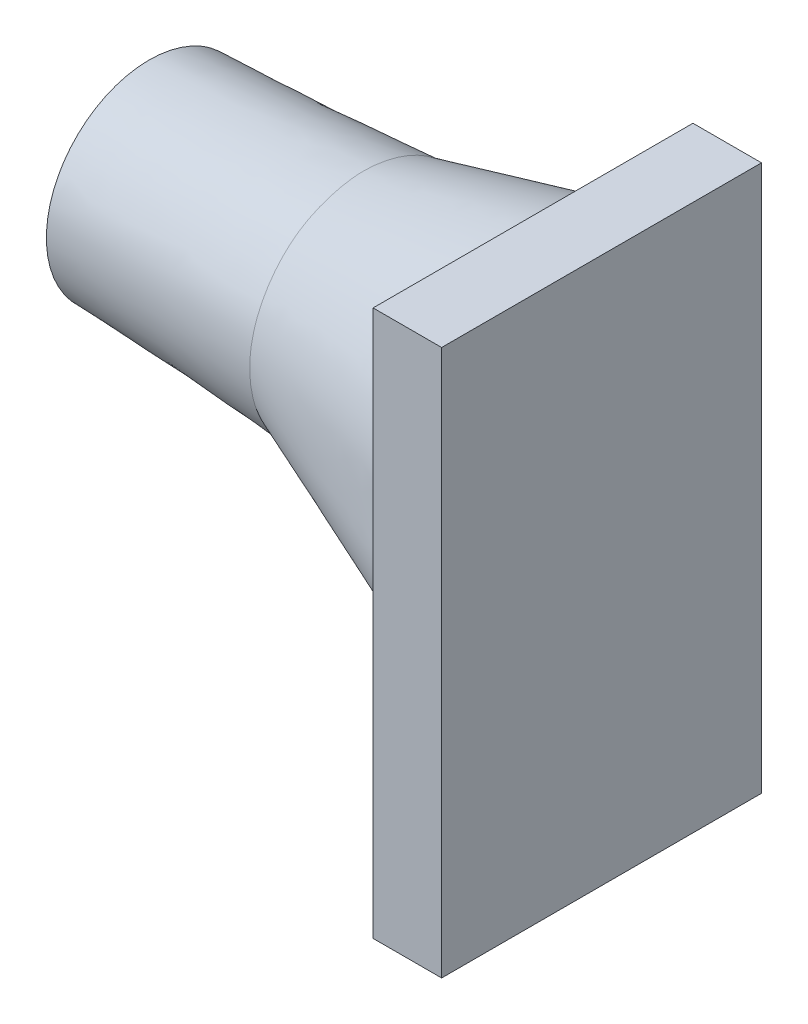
ISO-10303-21;
HEADER;
FILE_DESCRIPTION(('STEP AP214'),'2;1');
FILE_NAME('part.step','',(''),(''),'','','');
FILE_SCHEMA(('AUTOMOTIVE_DESIGN { 1 0 10303 214 1 1 1 1 }'));
ENDSEC;
DATA;
#1=APPLICATION_CONTEXT('core data for automotive mechanical design processes');
#2=APPLICATION_PROTOCOL_DEFINITION('international standard','automotive_design',2000,#1);
#3=PRODUCT_CONTEXT('',#1,'mechanical');
#4=PRODUCT('Part','Part','',(#3));
#5=PRODUCT_RELATED_PRODUCT_CATEGORY('part','',(#4));
#6=PRODUCT_DEFINITION_FORMATION('','',#4);
#7=PRODUCT_DEFINITION_CONTEXT('part definition',#1,'design');
#8=PRODUCT_DEFINITION('design','',#6,#7);
#9=PRODUCT_DEFINITION_SHAPE('','',#8);
#10=(LENGTH_UNIT() NAMED_UNIT(*) SI_UNIT(.MILLI.,.METRE.));
#11=(NAMED_UNIT(*) PLANE_ANGLE_UNIT() SI_UNIT($,.RADIAN.));
#12=(NAMED_UNIT(*) SI_UNIT($,.STERADIAN.) SOLID_ANGLE_UNIT());
#13=UNCERTAINTY_MEASURE_WITH_UNIT(LENGTH_MEASURE(1.E-05),#10,'distance_accuracy_value','');
#14=(GEOMETRIC_REPRESENTATION_CONTEXT(3) GLOBAL_UNCERTAINTY_ASSIGNED_CONTEXT((#13)) GLOBAL_UNIT_ASSIGNED_CONTEXT((#10,
#11,#12)) REPRESENTATION_CONTEXT('',''));
#15=CARTESIAN_POINT('',(0.,0.,0.));
#16=DIRECTION('',(0.,0.,1.));
#17=DIRECTION('',(1.,0.,0.));
#18=AXIS2_PLACEMENT_3D('',#15,#16,#17);
#19=CARTESIAN_POINT('',(0.,0.,35.));
#20=DIRECTION('',(0.,-1.,0.));
#21=DIRECTION('',(0.,0.,-1.));
#22=AXIS2_PLACEMENT_3D('',#19,#20,#21);
#23=PLANE('',#22);
#24=DIRECTION('',(-1.,0.,0.));
#25=VECTOR('',#24,1.);
#26=CARTESIAN_POINT('',(0.,0.,-35.));
#27=LINE('',#26,#25);
#28=CARTESIAN_POINT('',(15.,0.,-35.));
#29=VERTEX_POINT('',#28);
#30=CARTESIAN_POINT('',(0.,0.,-35.));
#31=VERTEX_POINT('',#30);
#32=EDGE_CURVE('E266',#29,#31,#27,.T.);
#33=ORIENTED_EDGE('',*,*,#32,.T.);
#34=DIRECTION('',(0.,0.,-1.));
#35=VECTOR('',#34,1.);
#36=CARTESIAN_POINT('',(0.,0.,35.));
#37=LINE('',#36,#35);
#38=CARTESIAN_POINT('',(0.,0.,35.));
#39=VERTEX_POINT('',#38);
#40=EDGE_CURVE('E12',#39,#31,#37,.T.);
#41=ORIENTED_EDGE('',*,*,#40,.F.);
#42=DIRECTION('',(-1.,0.,0.));
#43=VECTOR('',#42,1.);
#44=CARTESIAN_POINT('',(0.,0.,35.));
#45=LINE('',#44,#43);
#46=CARTESIAN_POINT('',(15.,0.,35.));
#47=VERTEX_POINT('',#46);
#48=EDGE_CURVE('E333',#47,#39,#45,.T.);
#49=ORIENTED_EDGE('',*,*,#48,.F.);
#50=DIRECTION('',(0.,0.,-1.));
#51=VECTOR('',#50,1.);
#52=CARTESIAN_POINT('',(15.,0.,35.));
#53=LINE('',#52,#51);
#54=EDGE_CURVE('E320',#47,#29,#53,.T.);
#55=ORIENTED_EDGE('',*,*,#54,.T.);
#56=EDGE_LOOP('',(#33,#41,#49,#55));
#57=FACE_BOUND('',#56,.T.);
#58=ADVANCED_FACE('F203',(#57),#23,.F.);
#59=CARTESIAN_POINT('',(0.,0.,35.));
#60=DIRECTION('',(1.,0.,0.));
#61=DIRECTION('',(0.,1.,0.));
#62=AXIS2_PLACEMENT_3D('',#59,#60,#61);
#63=PLANE('',#62);
#64=DIRECTION('',(0.,-1.,0.));
#65=VECTOR('',#64,1.);
#66=CARTESIAN_POINT('',(0.,-35.,-34.));
#67=LINE('',#66,#65);
#68=CARTESIAN_POINT('',(0.,-35.,-34.));
#69=VERTEX_POINT('',#68);
#70=CARTESIAN_POINT('',(0.,-47.,-34.));
#71=VERTEX_POINT('',#70);
#72=EDGE_CURVE('E254',#69,#71,#67,.T.);
#73=ORIENTED_EDGE('',*,*,#72,.F.);
#74=CARTESIAN_POINT('',(0.,-35.,34.));
#75=CARTESIAN_POINT('',(0.,-34.3338095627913,34.0000388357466));
#76=CARTESIAN_POINT('',(0.,-33.6676087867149,33.980598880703));
#77=CARTESIAN_POINT('',(0.,-32.3375035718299,33.9027408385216));
#78=CARTESIAN_POINT('',(0.,-31.6735990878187,33.8443235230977));
#79=CARTESIAN_POINT('',(0.,-30.3503880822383,33.6884915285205));
#80=CARTESIAN_POINT('',(0.,-29.6910814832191,33.591077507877));
#81=CARTESIAN_POINT('',(0.,-28.3799621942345,33.357578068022));
#82=CARTESIAN_POINT('',(0.,-27.7281433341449,33.2215272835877));
#83=CARTESIAN_POINT('',(0.,-26.4336825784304,32.9112238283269));
#84=CARTESIAN_POINT('',(0.,-25.7910403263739,32.7369726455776));
#85=CARTESIAN_POINT('',(0.,-24.5171801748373,32.3510165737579));
#86=CARTESIAN_POINT('',(0.,-23.8859616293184,32.1393138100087));
#87=CARTESIAN_POINT('',(0.,-22.3657292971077,31.5793547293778));
#88=CARTESIAN_POINT('',(0.,-21.4837856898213,31.2117193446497));
#89=CARTESIAN_POINT('',(0.,-19.7536541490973,30.4040413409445));
#90=CARTESIAN_POINT('',(0.,-18.9054666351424,29.9639978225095));
#91=CARTESIAN_POINT('',(0.,-17.6631632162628,29.2523001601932));
#92=CARTESIAN_POINT('',(0.,-17.2540692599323,29.0064697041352));
#93=CARTESIAN_POINT('',(0.,-16.4464600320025,28.4980069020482));
#94=CARTESIAN_POINT('',(0.,-16.0479449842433,28.2353742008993));
#95=CARTESIAN_POINT('',(0.,-14.8694014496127,27.4228327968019));
#96=CARTESIAN_POINT('',(0.,-14.1061698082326,26.8481635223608));
#97=CARTESIAN_POINT('',(0.,-12.8726213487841,25.8349975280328));
#98=CARTESIAN_POINT('',(0.,-12.38819047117,25.4134879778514));
#99=CARTESIAN_POINT('',(0.,-11.4441807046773,24.5434005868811));
#100=CARTESIAN_POINT('',(0.,-10.9846021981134,24.0948223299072));
#101=CARTESIAN_POINT('',(0.,-10.0920091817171,23.1719828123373));
#102=CARTESIAN_POINT('',(0.,-9.65899492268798,22.6977213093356));
#103=CARTESIAN_POINT('',(0.,-8.82099235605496,21.7250306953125));
#104=CARTESIAN_POINT('',(0.,-8.41600445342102,21.2266012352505));
#105=CARTESIAN_POINT('',(0.,-7.63546620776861,20.2072179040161));
#106=CARTESIAN_POINT('',(0.,-7.25991577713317,19.6862640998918));
#107=CARTESIAN_POINT('',(0.,-6.53951634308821,18.6235500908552));
#108=CARTESIAN_POINT('',(0.,-6.19466522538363,18.0817913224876));
#109=CARTESIAN_POINT('',(0.,-5.7051358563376,17.2615047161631));
#110=CARTESIAN_POINT('',(0.,-5.54833059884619,16.9901468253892));
#111=CARTESIAN_POINT('',(0.,-5.24241212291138,16.4431290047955));
#112=CARTESIAN_POINT('',(0.,-5.09329890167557,16.1674690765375));
#113=CARTESIAN_POINT('',(0.,-4.65745903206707,15.3344724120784));
#114=CARTESIAN_POINT('',(0.,-4.3822090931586,14.7710800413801));
#115=CARTESIAN_POINT('',(0.,-3.86268576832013,13.6302296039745));
#116=CARTESIAN_POINT('',(0.,-3.61841274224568,13.0527713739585));
#117=CARTESIAN_POINT('',(0.,-3.16116018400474,11.8854455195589));
#118=CARTESIAN_POINT('',(0.,-2.94818743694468,11.2955752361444));
#119=CARTESIAN_POINT('',(0.,-2.55412783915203,10.1052947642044));
#120=CARTESIAN_POINT('',(0.,-2.37304027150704,9.50488481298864));
#121=CARTESIAN_POINT('',(0.,-2.04335619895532,8.2951457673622));
#122=CARTESIAN_POINT('',(0.,-1.89476285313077,7.68581581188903));
#123=CARTESIAN_POINT('',(0.,-1.62596622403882,6.43771066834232));
#124=CARTESIAN_POINT('',(0.,-1.50699138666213,5.79867031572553));
#125=CARTESIAN_POINT('',(0.,-1.30560849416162,4.51485472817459));
#126=CARTESIAN_POINT('',(0.,-1.22319971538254,3.87007960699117));
#127=CARTESIAN_POINT('',(0.,-1.09597841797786,2.57689162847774));
#128=CARTESIAN_POINT('',(0.,-1.05116179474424,1.92847917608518));
#129=CARTESIAN_POINT('',(0.,-1.00030860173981,0.630302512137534));
#130=CARTESIAN_POINT('',(0.,-0.994258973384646,-0.019461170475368));
#131=CARTESIAN_POINT('',(0.,-1.01416188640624,-0.993451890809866));
#132=CARTESIAN_POINT('',(0.,-1.02562815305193,-1.31803634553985));
#133=CARTESIAN_POINT('',(0.,-1.05819906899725,-1.96672163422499));
#134=CARTESIAN_POINT('',(0.,-1.07930371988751,-2.29082246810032));
#135=CARTESIAN_POINT('',(0.,-1.15686019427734,-3.26196762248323));
#136=CARTESIAN_POINT('',(0.,-1.22755609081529,-3.90792816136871));
#137=CARTESIAN_POINT('',(0.,-1.40253226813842,-5.1709613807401));
#138=CARTESIAN_POINT('',(0.,-1.50547881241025,-5.78822134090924));
#139=CARTESIAN_POINT('',(0.,-1.74469793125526,-7.01623235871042));
#140=CARTESIAN_POINT('',(0.,-1.88096935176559,-7.62698364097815));
#141=CARTESIAN_POINT('',(0.,-2.1860870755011,-8.84030252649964));
#142=CARTESIAN_POINT('',(0.,-2.35493420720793,-9.44286992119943));
#143=CARTESIAN_POINT('',(0.,-2.7246783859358,-10.6384216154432));
#144=CARTESIAN_POINT('',(0.,-2.92559147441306,-11.2314009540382));
#145=CARTESIAN_POINT('',(0.,-3.35887111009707,-12.4057387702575));
#146=CARTESIAN_POINT('',(0.,-3.59123677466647,-12.9870975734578));
#147=CARTESIAN_POINT('',(0.,-4.08700049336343,-14.1364480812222));
#148=CARTESIAN_POINT('',(0.,-4.35039911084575,-14.7044395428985));
#149=CARTESIAN_POINT('',(0.,-4.91993632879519,-15.8490822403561));
#150=CARTESIAN_POINT('',(0.,-5.22742114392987,-16.4250647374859));
#151=CARTESIAN_POINT('',(0.,-5.87531832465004,-17.5582371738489));
#152=CARTESIAN_POINT('',(0.,-6.21573190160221,-18.1154264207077));
#153=CARTESIAN_POINT('',(0.,-6.92867209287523,-19.2088687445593));
#154=CARTESIAN_POINT('',(0.,-7.30119843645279,-19.7451219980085));
#155=CARTESIAN_POINT('',(0.,-8.07691923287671,-20.7944676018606));
#156=CARTESIAN_POINT('',(0.,-8.48009523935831,-21.3075735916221));
#157=CARTESIAN_POINT('',(0.,-9.31584470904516,-22.3092897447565));
#158=CARTESIAN_POINT('',(0.,-9.74841892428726,-22.7978992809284));
#159=CARTESIAN_POINT('',(0.,-10.6413190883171,-23.7489748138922));
#160=CARTESIAN_POINT('',(0.,-11.1016439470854,-24.2114418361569));
#161=CARTESIAN_POINT('',(0.,-12.2581033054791,-25.3075477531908));
#162=CARTESIAN_POINT('',(0.,-12.9684172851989,-25.9263321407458));
#163=CARTESIAN_POINT('',(0.,-14.4380068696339,-27.1025518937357));
#164=CARTESIAN_POINT('',(0.,-15.19728150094,-27.6599884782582));
#165=CARTESIAN_POINT('',(0.,-16.7598079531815,-28.7107249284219));
#166=CARTESIAN_POINT('',(0.,-17.563093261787,-29.2039749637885));
#167=CARTESIAN_POINT('',(0.,-19.2073925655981,-30.1231190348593));
#168=CARTESIAN_POINT('',(0.,-20.0484065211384,-30.5490131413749));
#169=CARTESIAN_POINT('',(0.,-21.4880942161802,-31.2051174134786));
#170=CARTESIAN_POINT('',(0.,-22.0781889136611,-31.4543327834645));
#171=CARTESIAN_POINT('',(0.,-23.2715305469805,-31.9191601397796));
#172=CARTESIAN_POINT('',(0.,-23.8747778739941,-32.1347711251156));
#173=CARTESIAN_POINT('',(0.,-25.0925789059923,-32.5315261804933));
#174=CARTESIAN_POINT('',(0.,-25.7071340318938,-32.7126658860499));
#175=CARTESIAN_POINT('',(0.,-26.9444220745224,-33.0395267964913));
#176=CARTESIAN_POINT('',(0.,-27.567138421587,-33.1853106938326));
#177=CARTESIAN_POINT('',(0.,-28.8197499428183,-33.4413160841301));
#178=CARTESIAN_POINT('',(0.,-29.449644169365,-33.5515422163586));
#179=CARTESIAN_POINT('',(0.,-30.7143221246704,-33.7361026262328));
#180=CARTESIAN_POINT('',(0.,-31.3491029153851,-33.8104569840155));
#181=CARTESIAN_POINT('',(0.,-32.4869121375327,-33.9113140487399));
#182=CARTESIAN_POINT('',(0.,-32.9893493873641,-33.9446187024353));
#183=CARTESIAN_POINT('',(0.,-33.9945207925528,-33.98895188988));
#184=CARTESIAN_POINT('',(0.,-34.4972536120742,-34.0000106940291));
#185=CARTESIAN_POINT('',(0.,-35.,-34.));
#186=B_SPLINE_CURVE_WITH_KNOTS('',3,(#74,#75,#76,#77,#78,#79,#80,#81,#82,#83,#84,#85,#86,#87,
#88,#89,#90,#91,#92,#93,#94,#95,#96,#97,#98,#99,#100,#101,#102,#103,#104,#105,#106,#107,#108,
#109,#110,#111,#112,#113,#114,#115,#116,#117,#118,#119,#120,#121,#122,#123,#124,#125,#126,#127,
#128,#129,#130,#131,#132,#133,#134,#135,#136,#137,#138,#139,#140,#141,#142,#143,#144,#145,#146,
#147,#148,#149,#150,#151,#152,#153,#154,#155,#156,#157,#158,#159,#160,#161,#162,#163,#164,#165,
#166,#167,#168,#169,#170,#171,#172,#173,#174,#175,#176,#177,#178,#179,#180,#181,#182,#183,#184,
#185),.UNSPECIFIED.,.F.,.F.,(4,2,2,2,2,2,2,2,2,2,2,2,2,2,2,2,2,2,2,2,2,2,2,2,2,2,2,2,2,2,2,2,2,
2,2,2,2,2,2,2,2,2,2,2,2,2,2,2,2,2,2,2,2,2,2,4),(0.,1.99830192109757,3.99656427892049,
5.99479289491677,7.99123588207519,9.9876011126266,11.9838530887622,14.8468877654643,
17.7099580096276,19.1414141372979,20.572900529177,23.4351675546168,25.3606761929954,
27.2862144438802,29.2117708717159,31.1373551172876,33.0629336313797,34.9883794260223,
35.9284900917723,36.8686004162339,38.7486859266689,40.6287932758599,42.5093075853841,
44.3897796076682,46.2704343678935,48.2194570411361,50.1684411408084,52.1172124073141,
54.0653271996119,55.0395649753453,56.013802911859,57.9620583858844,59.838512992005,
61.7149026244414,63.5913399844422,65.4687190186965,67.3460453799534,69.2234058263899,
71.181065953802,73.1387981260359,75.0965137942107,77.0530604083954,79.0096570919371,
80.9661769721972,83.7888193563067,86.6114056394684,89.436170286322,92.2609319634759,
94.1816927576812,96.1025107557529,98.0235717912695,99.9412011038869,101.858580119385,
103.774884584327,105.285028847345,106.793116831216),.UNSPECIFIED.);
#187=CARTESIAN_POINT('',(0.,-35.,34.));
#188=VERTEX_POINT('',#187);
#189=EDGE_CURVE('E224',#188,#69,#186,.T.);
#190=ORIENTED_EDGE('',*,*,#189,.F.);
#191=DIRECTION('',(0.,1.,0.));
#192=VECTOR('',#191,1.);
#193=CARTESIAN_POINT('',(0.,-35.,34.));
#194=LINE('',#193,#192);
#195=CARTESIAN_POINT('',(0.,-47.,34.));
#196=VERTEX_POINT('',#195);
#197=EDGE_CURVE('E259',#196,#188,#194,.T.);
#198=ORIENTED_EDGE('',*,*,#197,.F.);
#199=CARTESIAN_POINT('',(0.,-47.,-34.));
#200=CARTESIAN_POINT('',(0.,-47.6661904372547,-34.0000388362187));
#201=CARTESIAN_POINT('',(0.,-48.3323912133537,-33.9805988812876));
#202=CARTESIAN_POINT('',(0.,-49.6624964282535,-33.9027408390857));
#203=CARTESIAN_POINT('',(0.,-50.3264009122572,-33.8443235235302));
#204=CARTESIAN_POINT('',(0.,-51.6496119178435,-33.6884915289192));
#205=CARTESIAN_POINT('',(0.,-52.3089185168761,-33.591077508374));
#206=CARTESIAN_POINT('',(0.,-53.6200378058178,-33.3575780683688));
#207=CARTESIAN_POINT('',(0.,-54.2718566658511,-33.2215272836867));
#208=CARTESIAN_POINT('',(0.,-55.5663174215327,-32.9112238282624));
#209=CARTESIAN_POINT('',(0.,-56.2089596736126,-32.7369726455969));
#210=CARTESIAN_POINT('',(0.,-57.4828198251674,-32.3510165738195));
#211=CARTESIAN_POINT('',(0.,-58.114038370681,-32.1393138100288));
#212=CARTESIAN_POINT('',(0.,-59.6342707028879,-31.579354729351));
#213=CARTESIAN_POINT('',(0.,-60.5162143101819,-31.2117193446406));
#214=CARTESIAN_POINT('',(0.,-62.2463458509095,-30.404041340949));
#215=CARTESIAN_POINT('',(0.,-63.0945333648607,-29.9639978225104));
#216=CARTESIAN_POINT('',(0.,-64.336836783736,-29.2523001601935));
#217=CARTESIAN_POINT('',(0.,-64.7459307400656,-29.0064697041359));
#218=CARTESIAN_POINT('',(0.,-65.5535399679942,-28.498006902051));
#219=CARTESIAN_POINT('',(0.,-65.9520550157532,-28.2353742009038));
#220=CARTESIAN_POINT('',(0.,-67.1305985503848,-27.4228327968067));
#221=CARTESIAN_POINT('',(0.,-67.8938301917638,-26.8481635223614));
#222=CARTESIAN_POINT('',(0.,-69.1273786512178,-25.8349975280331));
#223=CARTESIAN_POINT('',(0.,-69.6118095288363,-25.4134879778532));
#224=CARTESIAN_POINT('',(0.,-70.5558192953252,-24.5434005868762));
#225=CARTESIAN_POINT('',(0.,-71.0153978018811,-24.094822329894));
#226=CARTESIAN_POINT('',(0.,-71.9079908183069,-23.1719828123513));
#227=CARTESIAN_POINT('',(0.,-72.3410050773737,-22.6977213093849));
#228=CARTESIAN_POINT('',(0.,-73.1790076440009,-21.7250306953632));
#229=CARTESIAN_POINT('',(0.,-73.5839955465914,-21.2266012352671));
#230=CARTESIAN_POINT('',(0.,-74.3645337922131,-20.2072179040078));
#231=CARTESIAN_POINT('',(0.,-74.7400842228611,-19.6862640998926));
#232=CARTESIAN_POINT('',(0.,-75.4604836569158,-18.6235500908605));
#233=CARTESIAN_POINT('',(0.,-75.8053347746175,-18.0817913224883));
#234=CARTESIAN_POINT('',(0.,-76.2948641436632,-17.2615047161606));
#235=CARTESIAN_POINT('',(0.,-76.4516694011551,-16.9901468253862));
#236=CARTESIAN_POINT('',(0.,-76.7575878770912,-16.4431290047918));
#237=CARTESIAN_POINT('',(0.,-76.9067010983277,-16.1674690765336));
#238=CARTESIAN_POINT('',(0.,-77.3425409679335,-15.3344724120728));
#239=CARTESIAN_POINT('',(0.,-77.6177909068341,-14.7710800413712));
#240=CARTESIAN_POINT('',(0.,-78.1373142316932,-13.6302296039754));
#241=CARTESIAN_POINT('',(0.,-78.3815872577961,-13.0527713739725));
#242=CARTESIAN_POINT('',(0.,-78.8388398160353,-11.8854455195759));
#243=CARTESIAN_POINT('',(0.,-79.0518125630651,-11.2955752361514));
#244=CARTESIAN_POINT('',(0.,-79.4458721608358,-10.105294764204));
#245=CARTESIAN_POINT('',(0.,-79.626959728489,-9.50488481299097));
#246=CARTESIAN_POINT('',(0.,-79.9566438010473,-8.29514576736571));
#247=CARTESIAN_POINT('',(0.,-80.1052371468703,-7.68581581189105));
#248=CARTESIAN_POINT('',(0.,-80.3740337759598,-6.43771066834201));
#249=CARTESIAN_POINT('',(0.,-80.4930086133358,-5.79867031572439));
#250=CARTESIAN_POINT('',(0.,-80.6943915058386,-4.51485472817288));
#251=CARTESIAN_POINT('',(0.,-80.7768002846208,-3.87007960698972));
#252=CARTESIAN_POINT('',(0.,-80.9040215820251,-2.57689162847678));
#253=CARTESIAN_POINT('',(0.,-80.9488382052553,-1.92847917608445));
#254=CARTESIAN_POINT('',(0.,-80.999691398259,-0.630302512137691));
#255=CARTESIAN_POINT('',(0.,-81.0057410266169,0.0194611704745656));
#256=CARTESIAN_POINT('',(0.,-80.9858381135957,0.99345189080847));
#257=CARTESIAN_POINT('',(0.,-80.9743718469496,1.31803634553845));
#258=CARTESIAN_POINT('',(0.,-80.9418009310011,1.96672163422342));
#259=CARTESIAN_POINT('',(0.,-80.9206962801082,2.29082246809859));
#260=CARTESIAN_POINT('',(0.,-80.8431398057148,3.26196762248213));
#261=CARTESIAN_POINT('',(0.,-80.7724439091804,3.90792816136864));
#262=CARTESIAN_POINT('',(0.,-80.597467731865,5.17096138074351));
#263=CARTESIAN_POINT('',(0.,-80.4945211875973,5.78822134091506));
#264=CARTESIAN_POINT('',(0.,-80.255302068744,7.01623235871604));
#265=CARTESIAN_POINT('',(0.,-80.1190306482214,7.62698364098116));
#266=CARTESIAN_POINT('',(0.,-79.8139129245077,8.84030252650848));
#267=CARTESIAN_POINT('',(0.,-79.6450657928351,9.44286992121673));
#268=CARTESIAN_POINT('',(0.,-79.27532161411,10.6384216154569));
#269=CARTESIAN_POINT('',(0.,-79.0744085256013,11.2314009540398));
#270=CARTESIAN_POINT('',(0.,-78.6411288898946,12.4057387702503));
#271=CARTESIAN_POINT('',(0.,-78.4087632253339,12.9870975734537));
#272=CARTESIAN_POINT('',(0.,-77.9129995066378,14.1364480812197));
#273=CARTESIAN_POINT('',(0.,-77.6496008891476,14.7044395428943));
#274=CARTESIAN_POINT('',(0.,-77.0800636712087,15.8490822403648));
#275=CARTESIAN_POINT('',(0.,-76.7725788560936,16.42506473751));
#276=CARTESIAN_POINT('',(0.,-76.1246816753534,17.5582371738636));
#277=CARTESIAN_POINT('',(0.,-75.7842680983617,18.1154264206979));
#278=CARTESIAN_POINT('',(0.,-75.0713279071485,19.2088687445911));
#279=CARTESIAN_POINT('',(0.,-74.6988015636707,19.7451219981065));
#280=CARTESIAN_POINT('',(0.,-73.9230807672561,20.7944676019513));
#281=CARTESIAN_POINT('',(0.,-73.5199047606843,21.3075735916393));
#282=CARTESIAN_POINT('',(0.,-72.684155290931,22.3092897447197));
#283=CARTESIAN_POINT('',(0.,-72.2515810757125,22.7978992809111));
#284=CARTESIAN_POINT('',(0.,-71.3586809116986,23.7489748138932));
#285=CARTESIAN_POINT('',(0.,-70.8983560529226,24.2114418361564));
#286=CARTESIAN_POINT('',(0.,-69.7418966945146,25.3075477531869));
#287=CARTESIAN_POINT('',(0.,-69.0315827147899,25.9263321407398));
#288=CARTESIAN_POINT('',(0.,-67.5619931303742,27.1025518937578));
#289=CARTESIAN_POINT('',(0.,-66.8027184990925,27.6599884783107));
#290=CARTESIAN_POINT('',(0.,-65.2401920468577,28.7107249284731));
#291=CARTESIAN_POINT('',(0.,-64.4369067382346,29.2039749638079));
#292=CARTESIAN_POINT('',(0.,-62.792607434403,30.1231190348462));
#293=CARTESIAN_POINT('',(0.,-61.9515934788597,30.5490131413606));
#294=CARTESIAN_POINT('',(0.,-60.5119057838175,31.2051174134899));
#295=CARTESIAN_POINT('',(0.,-59.9218110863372,31.454332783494));
#296=CARTESIAN_POINT('',(0.,-58.7284694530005,31.9191601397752));
#297=CARTESIAN_POINT('',(0.,-58.1252221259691,32.1347711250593));
#298=CARTESIAN_POINT('',(0.,-56.9074210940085,32.5315261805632));
#299=CARTESIAN_POINT('',(0.,-56.2928659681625,32.7126658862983));
#300=CARTESIAN_POINT('',(0.,-55.0555779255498,33.0395267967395));
#301=CARTESIAN_POINT('',(0.,-54.4328615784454,33.1853106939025));
#302=CARTESIAN_POINT('',(0.,-53.1802500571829,33.4413160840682));
#303=CARTESIAN_POINT('',(0.,-52.5503558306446,33.5515422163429));
#304=CARTESIAN_POINT('',(0.,-51.2856778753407,33.7361026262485));
#305=CARTESIAN_POINT('',(0.,-50.6508970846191,33.8104569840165));
#306=CARTESIAN_POINT('',(0.,-49.5130878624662,33.911314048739));
#307=CARTESIAN_POINT('',(0.,-49.0106506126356,33.9446187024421));
#308=CARTESIAN_POINT('',(0.,-48.0054792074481,33.9889518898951));
#309=CARTESIAN_POINT('',(0.,-47.5027463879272,34.0000106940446));
#310=CARTESIAN_POINT('',(0.,-47.,34.));
#311=B_SPLINE_CURVE_WITH_KNOTS('',3,(#199,#200,#201,#202,#203,#204,#205,#206,#207,#208,#209,
#210,#211,#212,#213,#214,#215,#216,#217,#218,#219,#220,#221,#222,#223,#224,#225,#226,#227,#228,
#229,#230,#231,#232,#233,#234,#235,#236,#237,#238,#239,#240,#241,#242,#243,#244,#245,#246,#247,
#248,#249,#250,#251,#252,#253,#254,#255,#256,#257,#258,#259,#260,#261,#262,#263,#264,#265,#266,
#267,#268,#269,#270,#271,#272,#273,#274,#275,#276,#277,#278,#279,#280,#281,#282,#283,#284,#285,
#286,#287,#288,#289,#290,#291,#292,#293,#294,#295,#296,#297,#298,#299,#300,#301,#302,#303,#304,
#305,#306,#307,#308,#309,#310),.UNSPECIFIED.,.F.,.F.,(4,2,2,2,2,2,2,2,2,2,2,2,2,2,2,2,2,2,2,2,2,
2,2,2,2,2,2,2,2,2,2,2,2,2,2,2,2,2,2,2,2,2,2,2,2,2,2,2,2,2,2,2,2,2,2,4),(0.,1.99830192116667,
3.99656427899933,5.99479289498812,7.99123588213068,9.98760111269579,11.9838530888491,
14.8468877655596,17.7099580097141,19.1414141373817,20.5729005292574,23.435167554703,
25.3606761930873,27.2862144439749,29.2117708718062,31.1373551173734,33.0629336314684,
34.9883794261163,35.9284900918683,36.8686004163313,38.7486859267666,40.6287932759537,
42.5093075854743,44.3897796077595,46.2704343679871,48.2194570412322,50.1684411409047,
52.117212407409,54.0653271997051,55.0395649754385,56.0138029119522,57.9620583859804,
59.8385129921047,61.7149026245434,63.5913399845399,65.4687190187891,67.3460453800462,
69.2234058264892,71.1810659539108,73.1387981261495,75.0965137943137,77.0530604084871,
79.0096570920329,80.9661769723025,83.7888193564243,86.6114056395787,89.4361702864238,
92.2609319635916,94.1816927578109,96.1025107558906,98.0235717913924,99.9412011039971,
101.858580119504,103.774884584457,105.285028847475,106.793116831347),.UNSPECIFIED.);
#312=EDGE_CURVE('E256',#71,#196,#311,.T.);
#313=ORIENTED_EDGE('',*,*,#312,.F.);
#314=EDGE_LOOP('',(#73,#190,#198,#313));
#315=FACE_BOUND('',#314,.T.);
#316=DIRECTION('',(0.,-1.,0.));
#317=VECTOR('',#316,1.);
#318=CARTESIAN_POINT('',(0.,0.,-35.));
#319=LINE('',#318,#317);
#320=CARTESIAN_POINT('',(0.,-119.5,-35.));
#321=VERTEX_POINT('',#320);
#322=EDGE_CURVE('E322',#31,#321,#319,.T.);
#323=ORIENTED_EDGE('',*,*,#322,.T.);
#324=DIRECTION('',(0.,0.,-1.));
#325=VECTOR('',#324,1.);
#326=CARTESIAN_POINT('',(0.,-119.5,35.));
#327=LINE('',#326,#325);
#328=CARTESIAN_POINT('',(0.,-119.5,35.));
#329=VERTEX_POINT('',#328);
#330=EDGE_CURVE('E216',#329,#321,#327,.T.);
#331=ORIENTED_EDGE('',*,*,#330,.F.);
#332=DIRECTION('',(0.,-1.,0.));
#333=VECTOR('',#332,1.);
#334=CARTESIAN_POINT('',(0.,0.,35.));
#335=LINE('',#334,#333);
#336=EDGE_CURVE('E336',#39,#329,#335,.T.);
#337=ORIENTED_EDGE('',*,*,#336,.F.);
#338=ORIENTED_EDGE('',*,*,#40,.T.);
#339=EDGE_LOOP('',(#323,#331,#337,#338));
#340=FACE_BOUND('',#339,.T.);
#341=ADVANCED_FACE('F262',(#315,#340),#63,.F.);
#342=CARTESIAN_POINT('',(0.,-119.5,35.));
#343=DIRECTION('',(0.,1.,0.));
#344=DIRECTION('',(0.,0.,1.));
#345=AXIS2_PLACEMENT_3D('',#342,#343,#344);
#346=PLANE('',#345);
#347=DIRECTION('',(1.,0.,0.));
#348=VECTOR('',#347,1.);
#349=CARTESIAN_POINT('',(0.,-119.5,-35.));
#350=LINE('',#349,#348);
#351=CARTESIAN_POINT('',(15.,-119.5,-35.));
#352=VERTEX_POINT('',#351);
#353=EDGE_CURVE('E324',#321,#352,#350,.T.);
#354=ORIENTED_EDGE('',*,*,#353,.T.);
#355=DIRECTION('',(0.,0.,-1.));
#356=VECTOR('',#355,1.);
#357=CARTESIAN_POINT('',(15.,-119.5,35.));
#358=LINE('',#357,#356);
#359=CARTESIAN_POINT('',(15.,-119.5,35.));
#360=VERTEX_POINT('',#359);
#361=EDGE_CURVE('E343',#360,#352,#358,.T.);
#362=ORIENTED_EDGE('',*,*,#361,.F.);
#363=DIRECTION('',(1.,0.,0.));
#364=VECTOR('',#363,1.);
#365=CARTESIAN_POINT('',(0.,-119.5,35.));
#366=LINE('',#365,#364);
#367=EDGE_CURVE('E338',#329,#360,#366,.T.);
#368=ORIENTED_EDGE('',*,*,#367,.F.);
#369=ORIENTED_EDGE('',*,*,#330,.T.);
#370=EDGE_LOOP('',(#354,#362,#368,#369));
#371=FACE_BOUND('',#370,.T.);
#372=ADVANCED_FACE('F289',(#371),#346,.F.);
#373=CARTESIAN_POINT('',(15.,-119.5,35.));
#374=DIRECTION('',(-1.,0.,0.));
#375=DIRECTION('',(0.,-1.,0.));
#376=AXIS2_PLACEMENT_3D('',#373,#374,#375);
#377=PLANE('',#376);
#378=DIRECTION('',(0.,1.,0.));
#379=VECTOR('',#378,1.);
#380=CARTESIAN_POINT('',(15.,-119.5,-35.));
#381=LINE('',#380,#379);
#382=EDGE_CURVE('E331',#352,#29,#381,.T.);
#383=ORIENTED_EDGE('',*,*,#382,.T.);
#384=ORIENTED_EDGE('',*,*,#54,.F.);
#385=DIRECTION('',(0.,1.,0.));
#386=VECTOR('',#385,1.);
#387=CARTESIAN_POINT('',(15.,-119.5,35.));
#388=LINE('',#387,#386);
#389=EDGE_CURVE('E340',#360,#47,#388,.T.);
#390=ORIENTED_EDGE('',*,*,#389,.F.);
#391=ORIENTED_EDGE('',*,*,#361,.T.);
#392=EDGE_LOOP('',(#383,#384,#390,#391));
#393=FACE_BOUND('',#392,.T.);
#394=ADVANCED_FACE('F293',(#393),#377,.F.);
#395=CARTESIAN_POINT('',(15.,0.,35.));
#396=DIRECTION('',(0.,0.,1.));
#397=DIRECTION('',(1.,0.,0.));
#398=AXIS2_PLACEMENT_3D('',#395,#396,#397);
#399=PLANE('',#398);
#400=ORIENTED_EDGE('',*,*,#48,.T.);
#401=ORIENTED_EDGE('',*,*,#336,.T.);
#402=ORIENTED_EDGE('',*,*,#367,.T.);
#403=ORIENTED_EDGE('',*,*,#389,.T.);
#404=EDGE_LOOP('',(#400,#401,#402,#403));
#405=FACE_BOUND('',#404,.T.);
#406=ADVANCED_FACE('F297',(#405),#399,.T.);
#407=CARTESIAN_POINT('',(15.,0.,-35.));
#408=DIRECTION('',(0.,0.,1.));
#409=DIRECTION('',(1.,0.,0.));
#410=AXIS2_PLACEMENT_3D('',#407,#408,#409);
#411=PLANE('',#410);
#412=ORIENTED_EDGE('',*,*,#32,.F.);
#413=ORIENTED_EDGE('',*,*,#382,.F.);
#414=ORIENTED_EDGE('',*,*,#353,.F.);
#415=ORIENTED_EDGE('',*,*,#322,.F.);
#416=EDGE_LOOP('',(#412,#413,#414,#415));
#417=FACE_BOUND('',#416,.T.);
#418=ADVANCED_FACE('F300',(#417),#411,.F.);
#419=CARTESIAN_POINT('',(-37.37,-39.2681060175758,-24.5257801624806));
#420=CARTESIAN_POINT('',(-37.,-39.3446597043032,-24.6195843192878));
#421=CARTESIAN_POINT('',(0.,-47.000028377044,-34.));
#422=CARTESIAN_POINT('',(-37.37,-38.7264258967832,-24.6228470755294));
#423=CARTESIAN_POINT('',(-37.,-38.8000598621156,-24.7156901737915));
#424=CARTESIAN_POINT('',(0.,-46.163456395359,-34.));
#425=CARTESIAN_POINT('',(-37.37,-38.0751255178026,-24.7174416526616));
#426=CARTESIAN_POINT('',(-37.,-38.1458690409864,-24.8093481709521));
#427=CARTESIAN_POINT('',(0.,-45.2202213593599,-34.0000000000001));
#428=CARTESIAN_POINT('',(-37.3699999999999,-36.7248782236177,-24.8562546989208));
#429=CARTESIAN_POINT('',(-36.9999999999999,-36.7904827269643,-24.9467868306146));
#430=CARTESIAN_POINT('',(0.,-43.3509330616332,-34.));
#431=CARTESIAN_POINT('',(-37.3699999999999,-35.2569220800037,-24.9370403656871));
#432=CARTESIAN_POINT('',(-36.9999999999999,-35.3178642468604,-25.0267726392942));
#433=CARTESIAN_POINT('',(0.,-41.412080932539,-34.));
#434=CARTESIAN_POINT('',(-37.3699999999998,-32.966702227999,-24.8687053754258));
#435=CARTESIAN_POINT('',(-36.9999999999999,-33.020656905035,-24.9591142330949));
#436=CARTESIAN_POINT('',(0.,-38.4161246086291,-34.0000000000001));
#437=CARTESIAN_POINT('',(-37.37,-31.4434180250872,-24.6747858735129));
#438=CARTESIAN_POINT('',(-37.,-31.4913459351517,-24.7671147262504));
#439=CARTESIAN_POINT('',(0.,-36.284136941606,-34.));
#440=CARTESIAN_POINT('',(-37.37,-29.2621111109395,-24.2839044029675));
#441=CARTESIAN_POINT('',(-37.,-29.2982815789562,-24.3801033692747));
#442=CARTESIAN_POINT('',(0.,-32.9153283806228,-34.));
#443=CARTESIAN_POINT('',(-37.3699999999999,-26.8257691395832,-23.6349776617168));
#444=CARTESIAN_POINT('',(-36.9999999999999,-26.8482912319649,-23.7341201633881));
#445=CARTESIAN_POINT('',(0.,-29.1005004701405,-33.6483703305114));
#446=CARTESIAN_POINT('',(-37.3699999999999,-23.4070989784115,-22.1460476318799));
#447=CARTESIAN_POINT('',(-36.9999999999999,-23.409218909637,-22.245510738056));
#448=CARTESIAN_POINT('',(0.,-23.6212120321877,-32.1918213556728));
#449=CARTESIAN_POINT('',(-37.3699999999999,-20.0624392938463,-20.0817991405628));
#450=CARTESIAN_POINT('',(-36.9999999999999,-20.043479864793,-20.1775763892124));
#451=CARTESIAN_POINT('',(0.,-18.1475369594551,-29.7553012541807));
#452=CARTESIAN_POINT('',(-37.37,-16.4974119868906,-16.9661989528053));
#453=CARTESIAN_POINT('',(-37.,-16.4546381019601,-17.0521527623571));
#454=CARTESIAN_POINT('',(0.,-12.1772496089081,-25.6475337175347));
#455=CARTESIAN_POINT('',(-37.3699999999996,-14.1944871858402,-13.8811224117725));
#456=CARTESIAN_POINT('',(-36.9999999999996,-14.1353154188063,-13.9539308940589));
#457=CARTESIAN_POINT('',(0.,-8.21813871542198,-21.2347791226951));
#458=CARTESIAN_POINT('',(-37.3700000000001,-12.8635945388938,-11.4476003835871));
#459=CARTESIAN_POINT('',(-37.0000000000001,-12.7946778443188,-11.5087665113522));
#460=CARTESIAN_POINT('',(0.,-5.90300838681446,-17.6253792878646));
#461=CARTESIAN_POINT('',(-37.3700000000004,-11.9579727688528,-9.58172045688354));
#462=CARTESIAN_POINT('',(-37.0000000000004,-11.8823513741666,-9.63370361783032));
#463=CARTESIAN_POINT('',(0.,-4.32021190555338,-14.8320197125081));
#464=CARTESIAN_POINT('',(-37.3700000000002,-10.7118777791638,-6.13185099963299));
#465=CARTESIAN_POINT('',(-37.0000000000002,-10.6268009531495,-6.16581642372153));
#466=CARTESIAN_POINT('',(0.,-2.11911835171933,-9.5623588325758));
#467=CARTESIAN_POINT('',(-37.37,-10.13979303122,-2.60021694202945));
#468=CARTESIAN_POINT('',(-37.,-10.0501808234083,-2.61466794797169));
#469=CARTESIAN_POINT('',(0.,-1.08896004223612,-4.05976854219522));
#470=CARTESIAN_POINT('',(-37.3699999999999,-10.0846259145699,-0.105303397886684));
#471=CARTESIAN_POINT('',(-36.9999999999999,-9.99459050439,-0.105888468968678));
#472=CARTESIAN_POINT('',(0.,-0.991049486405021,-0.164395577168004));
#473=CARTESIAN_POINT('',(-37.3699999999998,-10.1209832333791,2.24844721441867));
#474=CARTESIAN_POINT('',(-36.9999999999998,-10.0312276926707,2.26094326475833));
#475=CARTESIAN_POINT('',(0.,-1.05567362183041,3.51054829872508));
#476=CARTESIAN_POINT('',(-37.3699999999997,-10.6061648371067,5.70374066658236));
#477=CARTESIAN_POINT('',(-36.9999999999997,-10.5202590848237,5.73537276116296));
#478=CARTESIAN_POINT('',(0.,-1.92968385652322,8.89858221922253));
#479=CARTESIAN_POINT('',(-37.37,-11.6369456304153,8.73880459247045));
#480=CARTESIAN_POINT('',(-37.,-11.5589018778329,8.78642079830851));
#481=CARTESIAN_POINT('',(0.,-3.75452661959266,13.5480413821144));
#482=CARTESIAN_POINT('',(-37.37,-12.3175986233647,10.293841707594));
#483=CARTESIAN_POINT('',(-37.,-12.2446326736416,10.3492975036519));
#484=CARTESIAN_POINT('',(0.,-4.9480377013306,15.8948771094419));
#485=CARTESIAN_POINT('',(-37.37,-12.6992384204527,11.1300548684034));
#486=CARTESIAN_POINT('',(-37.,-12.6291108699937,11.1896969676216));
#487=CARTESIAN_POINT('',(0.,-5.61635582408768,17.1539068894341));
#488=CARTESIAN_POINT('',(-37.3699999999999,-13.7708105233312,13.1693526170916));
#489=CARTESIAN_POINT('',(-36.9999999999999,-13.7085639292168,13.2388318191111));
#490=CARTESIAN_POINT('',(0.,-7.48390451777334,20.1867520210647));
#491=CARTESIAN_POINT('',(-37.3699999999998,-15.8052313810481,16.0869186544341));
#492=CARTESIAN_POINT('',(-36.9999999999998,-15.7575450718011,16.1692192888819));
#493=CARTESIAN_POINT('',(0.,-10.9889141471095,24.3992827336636));
#494=CARTESIAN_POINT('',(-37.3699999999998,-17.8392770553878,18.1265042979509));
#495=CARTESIAN_POINT('',(-36.9999999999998,-17.8054700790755,18.2160713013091));
#496=CARTESIAN_POINT('',(0.,-14.4247724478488,27.1727716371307));
#497=CARTESIAN_POINT('',(-37.3700000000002,-20.3914292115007,20.2604268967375));
#498=CARTESIAN_POINT('',(-37.0000000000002,-20.3744954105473,20.3564121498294));
#499=CARTESIAN_POINT('',(0.,-18.6811153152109,29.9549374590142));
#500=CARTESIAN_POINT('',(-37.3699999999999,-22.741922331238,21.8289562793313));
#501=CARTESIAN_POINT('',(-36.9999999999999,-22.7400219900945,21.9282960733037));
#502=CARTESIAN_POINT('',(0.,-22.5499878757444,31.8622754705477));
#503=CARTESIAN_POINT('',(-37.3699999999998,-26.6878469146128,23.5874934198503));
#504=CARTESIAN_POINT('',(-36.9999999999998,-26.7095710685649,23.6867322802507));
#505=CARTESIAN_POINT('',(0.,-28.8819864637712,33.6106183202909));
#506=CARTESIAN_POINT('',(-37.37,-29.1175102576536,24.2579925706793));
#507=CARTESIAN_POINT('',(-37.,-29.1529016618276,24.3544480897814));
#508=CARTESIAN_POINT('',(0.,-32.692042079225,34.));
#509=CARTESIAN_POINT('',(-37.37,-31.1529236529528,24.6227305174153));
#510=CARTESIAN_POINT('',(-37.,-31.1992861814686,24.7155747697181));
#511=CARTESIAN_POINT('',(0.,-35.8355390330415,34.));
#512=CARTESIAN_POINT('',(-37.37,-32.1834895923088,24.7724451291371));
#513=CARTESIAN_POINT('',(-37.,-32.2344291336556,24.8638070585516));
#514=CARTESIAN_POINT('',(0.,-37.3283832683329,34.0000000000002));
#515=CARTESIAN_POINT('',(-37.37,-34.1482278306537,24.9279139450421));
#516=CARTESIAN_POINT('',(-37.,-34.2059444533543,25.0177365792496));
#517=CARTESIAN_POINT('',(0.,-39.9776067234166,34.));
#518=CARTESIAN_POINT('',(-37.3700000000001,-35.634812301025,24.9175452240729));
#519=CARTESIAN_POINT('',(-37.0000000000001,-35.6968555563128,25.007470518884));
#520=CARTESIAN_POINT('',(0.,-41.9011810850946,34.));
#521=CARTESIAN_POINT('',(-37.3700000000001,-37.4941261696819,24.7947381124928));
#522=CARTESIAN_POINT('',(-37.0000000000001,-37.5624731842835,24.8858793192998));
#523=CARTESIAN_POINT('',(0.,-44.3971746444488,34.));
#524=CARTESIAN_POINT('',(-37.37,-38.4365819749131,24.6747858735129));
#525=CARTESIAN_POINT('',(-37.,-38.5086540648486,24.7671147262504));
#526=CARTESIAN_POINT('',(0.,-45.7158630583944,34.));
#527=CARTESIAN_POINT('',(-37.37,-40.6178888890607,24.2839044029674));
#528=CARTESIAN_POINT('',(-37.,-40.701718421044,24.3801033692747));
#529=CARTESIAN_POINT('',(0.,-49.0846716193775,34.));
#530=CARTESIAN_POINT('',(-37.3699999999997,-43.0542308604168,23.6349776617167));
#531=CARTESIAN_POINT('',(-36.9999999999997,-43.151708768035,23.734120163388));
#532=CARTESIAN_POINT('',(0.,-52.8994995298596,33.6483703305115));
#533=CARTESIAN_POINT('',(-37.3699999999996,-46.4729010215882,22.1460476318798));
#534=CARTESIAN_POINT('',(-36.9999999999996,-46.5907810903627,22.245510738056));
#535=CARTESIAN_POINT('',(0.,-58.3787879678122,32.1918213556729));
#536=CARTESIAN_POINT('',(-37.37,-49.8175607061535,20.0817991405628));
#537=CARTESIAN_POINT('',(-37.,-49.9565201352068,20.1775763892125));
#538=CARTESIAN_POINT('',(0.,-63.8524630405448,29.7553012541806));
#539=CARTESIAN_POINT('',(-37.3699999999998,-53.3825880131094,16.9661989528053));
#540=CARTESIAN_POINT('',(-36.9999999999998,-53.54536189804,17.0521527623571));
#541=CARTESIAN_POINT('',(0.,-69.8227503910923,25.6475337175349));
#542=CARTESIAN_POINT('',(-37.3700000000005,-55.6855128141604,13.8811224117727));
#543=CARTESIAN_POINT('',(-37.0000000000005,-55.8646845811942,13.9539308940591));
#544=CARTESIAN_POINT('',(0.,-73.7818612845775,21.2347791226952));
#545=CARTESIAN_POINT('',(-37.37,-57.0164054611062,11.4476003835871));
#546=CARTESIAN_POINT('',(-37.,-57.2053221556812,11.5087665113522));
#547=CARTESIAN_POINT('',(0.,-76.096991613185,17.6253792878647));
#548=CARTESIAN_POINT('',(-37.3699999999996,-57.9220272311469,9.58172045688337));
#549=CARTESIAN_POINT('',(-36.9999999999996,-58.117648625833,9.63370361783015));
#550=CARTESIAN_POINT('',(0.,-77.6797880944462,14.8320197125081));
#551=CARTESIAN_POINT('',(-37.3699999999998,-59.1681222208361,6.13185099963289));
#552=CARTESIAN_POINT('',(-36.9999999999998,-59.3731990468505,6.16581642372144));
#553=CARTESIAN_POINT('',(0.,-79.8808816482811,9.56235883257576));
#554=CARTESIAN_POINT('',(-37.3700000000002,-59.7402069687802,2.60021694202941));
#555=CARTESIAN_POINT('',(-37.0000000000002,-59.9498191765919,2.61466794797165));
#556=CARTESIAN_POINT('',(0.,-80.9110399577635,4.05976854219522));
#557=CARTESIAN_POINT('',(-37.3700000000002,-59.7953740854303,0.105303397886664));
#558=CARTESIAN_POINT('',(-37.0000000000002,-60.0054094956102,0.105888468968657));
#559=CARTESIAN_POINT('',(0.,-81.0089505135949,0.164395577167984));
#560=CARTESIAN_POINT('',(-37.3700000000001,-59.759016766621,-2.24844721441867));
#561=CARTESIAN_POINT('',(-37.0000000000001,-59.9687723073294,-2.26094326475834));
#562=CARTESIAN_POINT('',(0.,-80.9443263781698,-3.51054829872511));
#563=CARTESIAN_POINT('',(-37.3699999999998,-59.2738351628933,-5.7037406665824));
#564=CARTESIAN_POINT('',(-36.9999999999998,-59.4797409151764,-5.735372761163));
#565=CARTESIAN_POINT('',(0.,-80.0703161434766,-8.89858221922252));
#566=CARTESIAN_POINT('',(-37.37,-58.2430543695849,-8.73880459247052));
#567=CARTESIAN_POINT('',(-37.,-58.4410981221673,-8.78642079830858));
#568=CARTESIAN_POINT('',(0.,-78.2454733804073,-13.5480413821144));
#569=CARTESIAN_POINT('',(-37.37,-57.5624013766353,-10.2938417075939));
#570=CARTESIAN_POINT('',(-37.,-57.7553673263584,-10.3492975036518));
#571=CARTESIAN_POINT('',(0.,-77.0519622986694,-15.894877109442));
#572=CARTESIAN_POINT('',(-37.37,-57.1807615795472,-11.1300548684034));
#573=CARTESIAN_POINT('',(-37.,-57.3708891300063,-11.1896969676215));
#574=CARTESIAN_POINT('',(0.,-76.3836441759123,-17.1539068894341));
#575=CARTESIAN_POINT('',(-37.37,-56.1091894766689,-13.1693526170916));
#576=CARTESIAN_POINT('',(-37.,-56.2914360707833,-13.2388318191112));
#577=CARTESIAN_POINT('',(0.,-74.5160954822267,-20.1867520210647));
#578=CARTESIAN_POINT('',(-37.3699999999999,-54.0747686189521,-16.0869186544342));
#579=CARTESIAN_POINT('',(-36.9999999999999,-54.242454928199,-16.169219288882));
#580=CARTESIAN_POINT('',(0.,-71.0110858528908,-24.3992827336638));
#581=CARTESIAN_POINT('',(-37.3699999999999,-52.0407229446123,-18.1265042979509));
#582=CARTESIAN_POINT('',(-36.9999999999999,-52.1945299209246,-18.2160713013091));
#583=CARTESIAN_POINT('',(0.,-67.5752275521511,-27.1727716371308));
#584=CARTESIAN_POINT('',(-37.37,-49.4885707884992,-20.2604268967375));
#585=CARTESIAN_POINT('',(-37.,-49.6255045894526,-20.3564121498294));
#586=CARTESIAN_POINT('',(0.,-63.3188846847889,-29.9549374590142));
#587=CARTESIAN_POINT('',(-37.3699999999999,-47.1380776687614,-21.8289562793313));
#588=CARTESIAN_POINT('',(-36.9999999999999,-47.2599780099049,-21.9282960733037));
#589=CARTESIAN_POINT('',(0.,-59.4500121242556,-31.8622754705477));
#590=CARTESIAN_POINT('',(-37.3699999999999,-43.1921530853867,-23.5874934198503));
#591=CARTESIAN_POINT('',(-36.9999999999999,-43.2904289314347,-23.6867322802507));
#592=CARTESIAN_POINT('',(0.,-53.118013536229,-33.6106183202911));
#593=CARTESIAN_POINT('',(-37.37,-40.7624897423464,-24.2579925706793));
#594=CARTESIAN_POINT('',(-37.,-40.8470983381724,-24.3544480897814));
#595=CARTESIAN_POINT('',(0.,-49.307957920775,-34.));
#596=CARTESIAN_POINT('',(-37.37,-39.2681060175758,-24.5257801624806));
#597=CARTESIAN_POINT('',(-37.,-39.3446597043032,-24.6195843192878));
#598=CARTESIAN_POINT('',(0.,-47.000028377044,-34.));
#599=B_SPLINE_SURFACE_WITH_KNOTS('',3,1,((#419,#420,#421),(#422,#423,#424),(#425,#426,#427),
(#428,#429,#430),(#431,#432,#433),(#434,#435,#436),(#437,#438,#439),(#440,#441,#442),(#443,#444,
#445),(#446,#447,#448),(#449,#450,#451),(#452,#453,#454),(#455,#456,#457),(#458,#459,#460),
(#461,#462,#463),(#464,#465,#466),(#467,#468,#469),(#470,#471,#472),(#473,#474,#475),(#476,#477,
#478),(#479,#480,#481),(#482,#483,#484),(#485,#486,#487),(#488,#489,#490),(#491,#492,#493),
(#494,#495,#496),(#497,#498,#499),(#500,#501,#502),(#503,#504,#505),(#506,#507,#508),(#509,#510,
#511),(#512,#513,#514),(#515,#516,#517),(#518,#519,#520),(#521,#522,#523),(#524,#525,#526),
(#527,#528,#529),(#530,#531,#532),(#533,#534,#535),(#536,#537,#538),(#539,#540,#541),(#542,#543,
#544),(#545,#546,#547),(#548,#549,#550),(#551,#552,#553),(#554,#555,#556),(#557,#558,#559),
(#560,#561,#562),(#563,#564,#565),(#566,#567,#568),(#569,#570,#571),(#572,#573,#574),(#575,#576,
#577),(#578,#579,#580),(#581,#582,#583),(#584,#585,#586),(#587,#588,#589),(#590,#591,#592),
(#593,#594,#595),(#596,#597,#598)),.UNSPECIFIED.,.T.,.F.,.F.,(4,1,1,1,1,2,1,1,1,1,1,1,1,1,1,1,1,
1,2,1,1,1,2,1,1,2,1,1,1,1,2,1,1,1,1,1,1,1,1,1,1,1,1,2,1,1,1,2,1,1,4),(2,1,2),(0.,
0.0105612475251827,0.0122882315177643,0.0248293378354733,0.0368370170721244,0.0530494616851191,
0.0793684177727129,0.101765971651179,0.125920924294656,0.156528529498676,0.194720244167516,
0.200726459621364,0.209991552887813,0.234438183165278,0.269956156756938,0.276524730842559,
0.281122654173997,0.31399906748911,0.341457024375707,0.346372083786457,0.359019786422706,
0.385742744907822,0.415500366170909,0.45128349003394,0.470863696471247,0.5,0.51054856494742,
0.519447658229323,0.535594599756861,0.536837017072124,0.553049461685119,0.579368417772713,
0.601765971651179,0.625920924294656,0.656528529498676,0.694720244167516,0.700726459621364,
0.709991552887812,0.734438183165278,0.769956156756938,0.77652473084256,0.781122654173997,
0.81399906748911,0.841457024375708,0.846372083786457,0.859019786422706,0.885742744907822,
0.915500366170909,0.95128349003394,0.970863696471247,1.),(-0.01,0.,1.),.UNSPECIFIED.);
#600=CARTESIAN_POINT('',(-36.99924664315,-35.0000005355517,-25.0000540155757));
#601=CARTESIAN_POINT('',(-36.999126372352,-34.8243991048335,-25.0000626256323));
#602=CARTESIAN_POINT('',(-36.9989708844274,-34.6487955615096,-24.998223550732));
#603=CARTESIAN_POINT('',(-36.9987849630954,-34.297664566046,-24.9908366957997));
#604=CARTESIAN_POINT('',(-36.9987545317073,-34.1221371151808,-24.9852888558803));
#605=CARTESIAN_POINT('',(-36.9988297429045,-33.7712282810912,-24.9704856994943));
#606=CARTESIAN_POINT('',(-36.9989353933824,-33.5958469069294,-24.9612301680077));
#607=CARTESIAN_POINT('',(-36.9989830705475,-33.2453179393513,-24.9390372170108));
#608=CARTESIAN_POINT('',(-36.9989250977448,-33.0701703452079,-24.9260998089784));
#609=CARTESIAN_POINT('',(-36.9987518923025,-32.7201459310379,-24.8965378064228));
#610=CARTESIAN_POINT('',(-36.9986366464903,-32.5452691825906,-24.8799123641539));
#611=CARTESIAN_POINT('',(-36.998569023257,-32.1959062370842,-24.8429676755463));
#612=CARTESIAN_POINT('',(-36.9986166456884,-32.0214200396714,-24.8226484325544));
#613=CARTESIAN_POINT('',(-36.9988824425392,-31.6729197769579,-24.7783251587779));
#614=CARTESIAN_POINT('',(-36.9991006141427,-31.4989057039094,-24.754321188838));
#615=CARTESIAN_POINT('',(-36.9995889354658,-31.1514211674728,-24.7026469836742));
#616=CARTESIAN_POINT('',(-36.9998590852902,-30.9779507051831,-24.6749767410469));
#617=CARTESIAN_POINT('',(-36.9999962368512,-30.7181150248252,-24.6307370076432));
#618=CARTESIAN_POINT('',(-36.9999972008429,-30.6315166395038,-24.6155254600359));
#619=CARTESIAN_POINT('',(-37.0000098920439,-30.4584853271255,-24.5841888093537));
#620=CARTESIAN_POINT('',(-37.0000216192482,-30.3720523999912,-24.5680637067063));
#621=CARTESIAN_POINT('',(-37.0000709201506,-30.1130171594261,-24.5183210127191));
#622=CARTESIAN_POINT('',(-37.0001226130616,-29.9406756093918,-24.4833355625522));
#623=CARTESIAN_POINT('',(-37.000233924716,-29.5967692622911,-24.4097353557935));
#624=CARTESIAN_POINT('',(-37.0002935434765,-29.4252044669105,-24.3711205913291));
#625=CARTESIAN_POINT('',(-37.0003989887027,-29.0829299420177,-24.2902815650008));
#626=CARTESIAN_POINT('',(-37.0004448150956,-28.9122202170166,-24.2480572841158));
#627=CARTESIAN_POINT('',(-37.0005327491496,-28.4015037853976,-24.1160024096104));
#628=CARTESIAN_POINT('',(-37.0005253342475,-28.0628691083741,-24.020781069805));
#629=CARTESIAN_POINT('',(-37.0002826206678,-27.3899557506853,-23.8161701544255));
#630=CARTESIAN_POINT('',(-37.0000473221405,-27.0556770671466,-23.7067805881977));
#631=CARTESIAN_POINT('',(-36.9989268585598,-26.0604288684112,-23.357691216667));
#632=CARTESIAN_POINT('',(-36.9976273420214,-25.4066354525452,-23.0969642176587));
#633=CARTESIAN_POINT('',(-36.9957006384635,-24.4444169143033,-22.6653666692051));
#634=CARTESIAN_POINT('',(-36.9950620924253,-24.1267199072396,-22.5147296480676));
#635=CARTESIAN_POINT('',(-36.9939325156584,-23.4979628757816,-22.2001905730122));
#636=CARTESIAN_POINT('',(-36.9934414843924,-23.1869028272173,-22.0362885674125));
#637=CARTESIAN_POINT('',(-36.9925751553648,-22.2647070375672,-21.5251604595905));
#638=CARTESIAN_POINT('',(-36.9928054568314,-21.6642139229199,-21.1583589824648));
#639=CARTESIAN_POINT('',(-36.9956952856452,-20.7885885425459,-20.5712159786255));
#640=CARTESIAN_POINT('',(-36.9970829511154,-20.5008653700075,-20.3693178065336));
#641=CARTESIAN_POINT('',(-37.0007459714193,-19.934224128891,-19.9535247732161));
#642=CARTESIAN_POINT('',(-37.0030212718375,-19.6553055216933,-19.7396306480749));
#643=CARTESIAN_POINT('',(-37.0088758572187,-19.016171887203,-19.2276869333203));
#644=CARTESIAN_POINT('',(-37.0126376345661,-18.6595252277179,-18.9251712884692));
#645=CARTESIAN_POINT('',(-37.0201455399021,-17.9637593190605,-18.3006240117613));
#646=CARTESIAN_POINT('',(-37.0238916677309,-17.6246402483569,-17.9785921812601));
#647=CARTESIAN_POINT('',(-37.0304972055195,-16.9649399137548,-17.3160570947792));
#648=CARTESIAN_POINT('',(-37.0333566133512,-16.6443586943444,-16.9755537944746));
#649=CARTESIAN_POINT('',(-37.0375715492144,-16.0226600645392,-16.2771163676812));
#650=CARTESIAN_POINT('',(-37.038926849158,-15.7215456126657,-15.9191796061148));
#651=CARTESIAN_POINT('',(-37.0397220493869,-15.1397595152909,-15.1870704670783));
#652=CARTESIAN_POINT('',(-37.0391619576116,-14.8590877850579,-14.8128981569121));
#653=CARTESIAN_POINT('',(-37.0358019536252,-14.3190304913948,-14.0494754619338));
#654=CARTESIAN_POINT('',(-37.0330020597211,-14.0596447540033,-13.6602252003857));
#655=CARTESIAN_POINT('',(-37.0269942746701,-13.6866342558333,-13.0651762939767));
#656=CARTESIAN_POINT('',(-37.0246833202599,-13.5647270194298,-12.8645140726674));
#657=CARTESIAN_POINT('',(-37.0194805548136,-13.3265766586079,-12.4598554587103));
#658=CARTESIAN_POINT('',(-37.0165887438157,-13.2103335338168,-12.2558590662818));
#659=CARTESIAN_POINT('',(-37.0101189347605,-12.9836001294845,-11.844702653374));
#660=CARTESIAN_POINT('',(-37.0065409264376,-12.8731099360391,-11.6375425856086));
#661=CARTESIAN_POINT('',(-36.9988116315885,-12.6579756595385,-11.2202192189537));
#662=CARTESIAN_POINT('',(-36.9946603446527,-12.5533315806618,-11.0100559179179));
#663=CARTESIAN_POINT('',(-36.9862537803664,-12.3499950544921,-10.5868629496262));
#664=CARTESIAN_POINT('',(-36.9819985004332,-12.2513027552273,-10.3738332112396));
#665=CARTESIAN_POINT('',(-36.9737089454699,-12.0599726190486,-9.94507576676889));
#666=CARTESIAN_POINT('',(-36.9696746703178,-11.9673347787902,-9.7293480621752));
#667=CARTESIAN_POINT('',(-36.95837653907,-11.6986657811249,-9.07840290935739));
#668=CARTESIAN_POINT('',(-36.9519152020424,-11.5318333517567,-8.63932815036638));
#669=CARTESIAN_POINT('',(-36.9426101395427,-11.2234062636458,-7.75241110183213));
#670=CARTESIAN_POINT('',(-36.9397662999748,-11.0818108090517,-7.30456908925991));
#671=CARTESIAN_POINT('',(-36.9379960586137,-10.8243342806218,-6.40155710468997));
#672=CARTESIAN_POINT('',(-36.9390693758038,-10.7084513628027,-5.94638766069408));
#673=CARTESIAN_POINT('',(-36.9439971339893,-10.5290317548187,-5.14730533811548));
#674=CARTESIAN_POINT('',(-36.9470709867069,-10.4596853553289,-4.80467796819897));
#675=CARTESIAN_POINT('',(-36.9546314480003,-10.3355155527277,-4.11679911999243));
#676=CARTESIAN_POINT('',(-36.9591180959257,-10.2806925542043,-3.77154756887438));
#677=CARTESIAN_POINT('',(-36.9686917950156,-10.1856115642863,-3.07905020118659));
#678=CARTESIAN_POINT('',(-36.9737788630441,-10.1453539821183,-2.73180432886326));
#679=CARTESIAN_POINT('',(-36.9834642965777,-10.0793967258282,-2.0359167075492));
#680=CARTESIAN_POINT('',(-36.9880626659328,-10.0536969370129,-1.68727496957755));
#681=CARTESIAN_POINT('',(-36.9935664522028,-10.0260257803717,-1.16371624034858));
#682=CARTESIAN_POINT('',(-36.9951688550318,-10.0186149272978,-0.989077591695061));
#683=CARTESIAN_POINT('',(-36.9977266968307,-10.0074108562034,-0.639676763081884));
#684=CARTESIAN_POINT('',(-36.9986821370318,-10.0036176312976,-0.464914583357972));
#685=CARTESIAN_POINT('',(-36.9997105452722,-9.99963431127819,-0.115350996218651));
#686=CARTESIAN_POINT('',(-36.9997835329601,-9.99944413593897,0.0594504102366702));
#687=CARTESIAN_POINT('',(-36.9990166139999,-10.0026645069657,0.409018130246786));
#688=CARTESIAN_POINT('',(-36.9981767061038,-10.0060750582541,0.583784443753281));
#689=CARTESIAN_POINT('',(-36.9958200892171,-10.0165123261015,0.933209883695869));
#690=CARTESIAN_POINT('',(-36.9943033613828,-10.0235391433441,1.10786900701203));
#691=CARTESIAN_POINT('',(-36.9907747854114,-10.0412181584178,1.45699566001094));
#692=CARTESIAN_POINT('',(-36.9887629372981,-10.0518703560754,1.63146318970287));
#693=CARTESIAN_POINT('',(-36.9822622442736,-10.0892797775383,2.15448345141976));
#694=CARTESIAN_POINT('',(-36.9773082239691,-10.1214899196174,2.50265687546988));
#695=CARTESIAN_POINT('',(-36.9673707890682,-10.2007759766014,3.19992669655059));
#696=CARTESIAN_POINT('',(-36.9623874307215,-10.2479609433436,3.54901061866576));
#697=CARTESIAN_POINT('',(-36.953423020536,-10.3571079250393,4.24486991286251));
#698=CARTESIAN_POINT('',(-36.9494419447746,-10.4190695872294,4.59164533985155));
#699=CARTESIAN_POINT('',(-36.9431842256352,-10.5577056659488,5.28223743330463));
#700=CARTESIAN_POINT('',(-36.9409074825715,-10.6343792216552,5.62605427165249));
#701=CARTESIAN_POINT('',(-36.938446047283,-10.8023243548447,6.31009244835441));
#702=CARTESIAN_POINT('',(-36.9382612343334,-10.8935950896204,6.65031399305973));
#703=CARTESIAN_POINT('',(-36.9401569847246,-11.0905643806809,7.32649277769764));
#704=CARTESIAN_POINT('',(-36.9422372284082,-11.1962608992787,7.66245061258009));
#705=CARTESIAN_POINT('',(-36.9485087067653,-11.421895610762,8.32956375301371));
#706=CARTESIAN_POINT('',(-36.9527000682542,-11.5418346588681,8.66071876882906));
#707=CARTESIAN_POINT('',(-36.9601749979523,-11.7322185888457,9.15336895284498));
#708=CARTESIAN_POINT('',(-36.9628648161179,-11.7974299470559,9.31691481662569));
#709=CARTESIAN_POINT('',(-36.9685426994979,-11.9313112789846,9.64258208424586));
#710=CARTESIAN_POINT('',(-36.971530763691,-11.9999812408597,9.80470349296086));
#711=CARTESIAN_POINT('',(-36.9776607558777,-12.1407394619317,10.1274528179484));
#712=CARTESIAN_POINT('',(-36.9808026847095,-12.2128277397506,10.288080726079));
#713=CARTESIAN_POINT('',(-36.9869918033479,-12.3603764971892,10.6077839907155));
#714=CARTESIAN_POINT('',(-36.9900389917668,-12.4358370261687,10.7668593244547));
#715=CARTESIAN_POINT('',(-36.9969597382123,-12.6144528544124,11.1333660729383));
#716=CARTESIAN_POINT('',(-37.0007903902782,-12.7188289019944,11.340204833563));
#717=CARTESIAN_POINT('',(-37.0080899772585,-12.9332708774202,11.7509206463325));
#718=CARTESIAN_POINT('',(-37.0115589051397,-13.0433369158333,11.9547976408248));
#719=CARTESIAN_POINT('',(-37.0179678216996,-13.2690589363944,12.3594277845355));
#720=CARTESIAN_POINT('',(-37.020907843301,-13.3847145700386,12.5601811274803));
#721=CARTESIAN_POINT('',(-37.0261337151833,-13.6215208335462,12.9584193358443));
#722=CARTESIAN_POINT('',(-37.0284195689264,-13.7426714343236,13.1559042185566));
#723=CARTESIAN_POINT('',(-37.0343206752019,-14.1142289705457,13.7432221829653));
#724=CARTESIAN_POINT('',(-37.0369802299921,-14.3727680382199,14.1279658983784));
#725=CARTESIAN_POINT('',(-37.0399487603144,-14.9107118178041,14.8826104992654));
#726=CARTESIAN_POINT('',(-37.0402575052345,-15.1901185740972,15.2525099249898));
#727=CARTESIAN_POINT('',(-37.0389476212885,-15.7689646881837,15.9763079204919));
#728=CARTESIAN_POINT('',(-37.0373289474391,-16.0684045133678,16.3302061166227));
#729=CARTESIAN_POINT('',(-37.0327128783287,-16.6864212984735,17.0208795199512));
#730=CARTESIAN_POINT('',(-37.0297154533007,-17.0049986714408,17.3576543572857));
#731=CARTESIAN_POINT('',(-37.0229768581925,-17.6649006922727,18.0175670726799));
#732=CARTESIAN_POINT('',(-37.019225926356,-18.0064800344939,18.3404502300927));
#733=CARTESIAN_POINT('',(-37.0116259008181,-18.7072877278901,18.9664601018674));
#734=CARTESIAN_POINT('',(-37.0077768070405,-19.0665160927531,19.2695868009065));
#735=CARTESIAN_POINT('',(-37.0016477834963,-19.801556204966,19.8550282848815));
#736=CARTESIAN_POINT('',(-36.9993678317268,-20.1773677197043,20.1373433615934));
#737=CARTESIAN_POINT('',(-36.9961270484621,-20.9443402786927,20.6802576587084));
#738=CARTESIAN_POINT('',(-36.9951661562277,-21.3355006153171,20.9408578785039));
#739=CARTESIAN_POINT('',(-36.9942972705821,-22.1319296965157,21.4395420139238));
#740=CARTESIAN_POINT('',(-36.9943892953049,-22.537198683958,21.6776255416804));
#741=CARTESIAN_POINT('',(-36.995119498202,-23.3605266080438,22.1305423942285));
#742=CARTESIAN_POINT('',(-36.9957576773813,-23.7785855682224,22.3453756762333));
#743=CARTESIAN_POINT('',(-36.9971430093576,-24.6240367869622,22.7501250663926));
#744=CARTESIAN_POINT('',(-36.9978896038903,-25.051372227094,22.940159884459));
#745=CARTESIAN_POINT('',(-36.9991840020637,-25.916019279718,23.2959817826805));
#746=CARTESIAN_POINT('',(-36.9997318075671,-26.3533307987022,23.4617690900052));
#747=CARTESIAN_POINT('',(-37.0004270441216,-27.2365426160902,23.7685877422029));
#748=CARTESIAN_POINT('',(-37.00057447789,-27.6824428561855,23.9096192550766));
#749=CARTESIAN_POINT('',(-37.0005818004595,-28.5814914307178,24.1664892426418));
#750=CARTESIAN_POINT('',(-37.0004416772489,-29.0346400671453,24.2823266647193));
#751=CARTESIAN_POINT('',(-37.0001981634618,-29.7186491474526,24.436883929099));
#752=CARTESIAN_POINT('',(-37.0001114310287,-29.9473806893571,24.4852055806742));
#753=CARTESIAN_POINT('',(-37.0000176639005,-30.4061078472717,24.5754088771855));
#754=CARTESIAN_POINT('',(-37.000010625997,-30.6361034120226,24.6172907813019));
#755=CARTESIAN_POINT('',(-36.9999432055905,-31.097176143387,24.6945907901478));
#756=CARTESIAN_POINT('',(-36.9998828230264,-31.328253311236,24.7300088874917));
#757=CARTESIAN_POINT('',(-36.9999174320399,-31.7913237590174,24.7943408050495));
#758=CARTESIAN_POINT('',(-37.0000124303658,-32.0233170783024,24.823254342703));
#759=CARTESIAN_POINT('',(-37.0000470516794,-32.4303634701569,24.8682064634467));
#760=CARTESIAN_POINT('',(-37.0000193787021,-32.6052618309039,24.8856595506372));
#761=CARTESIAN_POINT('',(-36.9999450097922,-32.9553910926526,24.9168750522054));
#762=CARTESIAN_POINT('',(-36.9998983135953,-33.1306219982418,24.9306374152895));
#763=CARTESIAN_POINT('',(-36.9997079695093,-33.4813437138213,24.954471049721));
#764=CARTESIAN_POINT('',(-36.9995643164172,-33.6568345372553,24.9645421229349));
#765=CARTESIAN_POINT('',(-36.9989599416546,-34.0079877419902,24.9810034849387));
#766=CARTESIAN_POINT('',(-36.9984992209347,-34.1836501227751,24.987393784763));
#767=CARTESIAN_POINT('',(-36.9977054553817,-34.5350683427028,24.9964589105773));
#768=CARTESIAN_POINT('',(-36.9973724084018,-34.7108241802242,24.9991337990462));
#769=CARTESIAN_POINT('',(-36.9970137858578,-35.0623528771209,25.0007542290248));
#770=CARTESIAN_POINT('',(-36.9969882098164,-35.2381257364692,24.9996997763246));
#771=CARTESIAN_POINT('',(-36.9972248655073,-35.5896077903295,24.9938633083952));
#772=CARTESIAN_POINT('',(-36.9974870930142,-35.7653169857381,24.9890813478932));
#773=CARTESIAN_POINT('',(-36.9981009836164,-36.1165910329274,24.9758068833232));
#774=CARTESIAN_POINT('',(-36.9984526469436,-36.2921558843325,24.9673143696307));
#775=CARTESIAN_POINT('',(-36.9990222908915,-36.8185319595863,24.936318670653));
#776=CARTESIAN_POINT('',(-36.9987550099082,-37.1690424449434,24.9082970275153));
#777=CARTESIAN_POINT('',(-36.9987080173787,-37.6936491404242,24.8551763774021));
#778=CARTESIAN_POINT('',(-36.9987513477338,-37.8683299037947,24.835620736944));
#779=CARTESIAN_POINT('',(-36.9989676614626,-38.2172431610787,24.7928202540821));
#780=CARTESIAN_POINT('',(-36.999140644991,-38.391475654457,24.769575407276));
#781=CARTESIAN_POINT('',(-36.9995467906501,-38.7394095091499,24.7194121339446));
#782=CARTESIAN_POINT('',(-36.9997799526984,-38.9131108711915,24.6924937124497));
#783=CARTESIAN_POINT('',(-37.0000064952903,-39.2599104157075,24.6350164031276));
#784=CARTESIAN_POINT('',(-36.9999998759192,-39.4330085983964,24.6044575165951));
#785=CARTESIAN_POINT('',(-37.0000285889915,-39.7785221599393,24.5396926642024));
#786=CARTESIAN_POINT('',(-37.0000639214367,-39.9509375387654,24.5054866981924));
#787=CARTESIAN_POINT('',(-37.0001388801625,-40.2950055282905,24.4334466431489));
#788=CARTESIAN_POINT('',(-37.0001785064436,-40.4666581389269,24.3956125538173));
#789=CARTESIAN_POINT('',(-37.0002838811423,-40.9802562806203,24.2767170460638));
#790=CARTESIAN_POINT('',(-37.0003361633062,-41.3209654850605,24.1902392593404));
#791=CARTESIAN_POINT('',(-37.0003257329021,-41.9984243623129,24.0030082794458));
#792=CARTESIAN_POINT('',(-37.0002630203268,-42.335174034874,23.9022550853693));
#793=CARTESIAN_POINT('',(-36.9999909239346,-43.0041387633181,23.6866476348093));
#794=CARTESIAN_POINT('',(-36.9997815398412,-43.3363538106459,23.5717933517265));
#795=CARTESIAN_POINT('',(-36.9992498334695,-43.995629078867,23.3281993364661));
#796=CARTESIAN_POINT('',(-36.9989275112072,-44.3226893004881,23.199459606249));
#797=CARTESIAN_POINT('',(-36.9979333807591,-45.295232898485,22.7927443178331));
#798=CARTESIAN_POINT('',(-36.9972342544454,-45.9322549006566,22.4942160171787));
#799=CARTESIAN_POINT('',(-36.9964002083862,-47.1788535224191,21.844506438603));
#800=CARTESIAN_POINT('',(-36.9962652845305,-47.7884303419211,21.4933255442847));
#801=CARTESIAN_POINT('',(-36.9970721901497,-48.6787847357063,20.9290449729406));
#802=CARTESIAN_POINT('',(-36.9975094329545,-48.9715853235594,20.7346865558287));
#803=CARTESIAN_POINT('',(-36.9987757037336,-49.5487349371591,20.3337681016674));
#804=CARTESIAN_POINT('',(-36.9996047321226,-49.8330839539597,20.1272080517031));
#805=CARTESIAN_POINT('',(-37.001547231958,-50.3928097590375,19.702267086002));
#806=CARTESIAN_POINT('',(-37.0026607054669,-50.6681864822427,19.4838860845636));
#807=CARTESIAN_POINT('',(-37.004972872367,-51.209470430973,19.0357226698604));
#808=CARTESIAN_POINT('',(-37.0061715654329,-51.4753776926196,18.8059403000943));
#809=CARTESIAN_POINT('',(-37.0096536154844,-52.2582276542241,18.1000701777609));
#810=CARTESIAN_POINT('',(-37.011823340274,-52.7603834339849,17.6073949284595));
#811=CARTESIAN_POINT('',(-37.0148346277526,-53.7214461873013,16.5815650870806));
#812=CARTESIAN_POINT('',(-37.0156761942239,-54.1803532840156,16.048410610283));
#813=CARTESIAN_POINT('',(-37.0156459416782,-54.9064861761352,15.1292913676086));
#814=CARTESIAN_POINT('',(-37.0152515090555,-55.1866393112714,14.7534603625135));
#815=CARTESIAN_POINT('',(-37.0136307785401,-55.7254596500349,13.9866351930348));
#816=CARTESIAN_POINT('',(-37.0124044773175,-55.984126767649,13.5956409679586));
#817=CARTESIAN_POINT('',(-37.0099337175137,-56.355346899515,12.9987876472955));
#818=CARTESIAN_POINT('',(-37.0090048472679,-56.4762961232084,12.798098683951));
#819=CARTESIAN_POINT('',(-37.0069508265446,-56.7125204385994,12.3934024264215));
#820=CARTESIAN_POINT('',(-37.005825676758,-56.8277955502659,12.1893951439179));
#821=CARTESIAN_POINT('',(-37.0033381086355,-57.052567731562,11.7782500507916));
#822=CARTESIAN_POINT('',(-37.0019757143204,-57.1620653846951,11.571112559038));
#823=CARTESIAN_POINT('',(-36.9990833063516,-57.3752031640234,11.1538542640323));
#824=CARTESIAN_POINT('',(-36.9975532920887,-57.4788432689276,10.9437334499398));
#825=CARTESIAN_POINT('',(-36.9929650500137,-57.7808374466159,10.3091270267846));
#826=CARTESIAN_POINT('',(-36.9899082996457,-57.9702891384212,9.88035398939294));
#827=CARTESIAN_POINT('',(-36.9846624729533,-58.324719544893,9.0128858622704));
#828=CARTESIAN_POINT('',(-36.9824733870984,-58.4896985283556,8.57419088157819));
#829=CARTESIAN_POINT('',(-36.9786671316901,-58.8710554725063,7.46614662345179));
#830=CARTESIAN_POINT('',(-36.9778852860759,-59.0718019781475,6.7913019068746));
#831=CARTESIAN_POINT('',(-36.9789445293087,-59.3295174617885,5.76835744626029));
#832=CARTESIAN_POINT('',(-36.9796698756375,-59.4081967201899,5.42554662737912));
#833=CARTESIAN_POINT('',(-36.9817257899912,-59.5509825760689,4.73691310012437));
#834=CARTESIAN_POINT('',(-36.9830562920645,-59.6150907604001,4.39109072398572));
#835=CARTESIAN_POINT('',(-36.9860974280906,-59.7286414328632,3.69700430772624));
#836=CARTESIAN_POINT('',(-36.9878081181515,-59.7780817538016,3.34873991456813));
#837=CARTESIAN_POINT('',(-36.9912796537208,-59.8622239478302,2.65042665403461));
#838=CARTESIAN_POINT('',(-36.9930405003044,-59.8969255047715,2.30037774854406));
#839=CARTESIAN_POINT('',(-36.9962029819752,-59.951555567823,1.59911723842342));
#840=CARTESIAN_POINT('',(-36.9976046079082,-59.9714836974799,1.24790560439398));
#841=CARTESIAN_POINT('',(-36.9995055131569,-59.9965688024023,0.544983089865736));
#842=CARTESIAN_POINT('',(-37.0000048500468,-60.0017267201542,0.193272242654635));
#843=CARTESIAN_POINT('',(-36.9996249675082,-59.9965581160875,-0.626525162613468));
#844=CARTESIAN_POINT('',(-36.9982345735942,-59.9805393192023,-1.09458707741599));
#845=CARTESIAN_POINT('',(-36.994504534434,-59.92231525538,-2.02905931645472));
#846=CARTESIAN_POINT('',(-36.9921648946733,-59.8801101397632,-2.4954696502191));
#847=CARTESIAN_POINT('',(-36.9875434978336,-59.7695758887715,-3.42518711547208));
#848=CARTESIAN_POINT('',(-36.9852617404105,-59.7012469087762,-3.88849426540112));
#849=CARTESIAN_POINT('',(-36.9815106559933,-59.5386361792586,-4.81048147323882));
#850=CARTESIAN_POINT('',(-36.9800412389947,-59.444357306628,-5.26916203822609));
#851=CARTESIAN_POINT('',(-36.9783401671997,-59.2301107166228,-6.18049320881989));
#852=CARTESIAN_POINT('',(-36.9781085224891,-59.1101427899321,-6.63314376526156));
#853=CARTESIAN_POINT('',(-36.9790676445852,-58.8448931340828,-7.53095225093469));
#854=CARTESIAN_POINT('',(-36.9802583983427,-58.6996116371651,-7.97611024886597));
#855=CARTESIAN_POINT('',(-36.9839033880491,-58.3842330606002,-8.85744421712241));
#856=CARTESIAN_POINT('',(-36.9863573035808,-58.2141422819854,-9.29362243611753));
#857=CARTESIAN_POINT('',(-36.9905776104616,-57.9408382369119,-9.94014575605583));
#858=CARTESIAN_POINT('',(-36.9920743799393,-57.8467033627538,-10.1543741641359));
#859=CARTESIAN_POINT('',(-36.9950473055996,-57.6524556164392,-10.5801109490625));
#860=CARTESIAN_POINT('',(-36.9965234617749,-57.5523427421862,-10.7916193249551));
#861=CARTESIAN_POINT('',(-36.9994129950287,-57.3462218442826,-11.2117448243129));
#862=CARTESIAN_POINT('',(-37.0008263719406,-57.2402138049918,-11.4203619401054));
#863=CARTESIAN_POINT('',(-37.0035362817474,-57.0223934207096,-11.8345369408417));
#864=CARTESIAN_POINT('',(-37.0048328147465,-56.9105810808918,-12.0400948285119));
#865=CARTESIAN_POINT('',(-37.0084252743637,-56.5665565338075,-12.6519717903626));
#866=CARTESIAN_POINT('',(-37.0104241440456,-56.3257514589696,-13.0535050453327));
#867=CARTESIAN_POINT('',(-37.0134786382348,-55.8220425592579,-13.842444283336));
#868=CARTESIAN_POINT('',(-37.0145342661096,-55.5591388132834,-14.2298503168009));
#869=CARTESIAN_POINT('',(-37.0157685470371,-55.0120766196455,-14.9893082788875));
#870=CARTESIAN_POINT('',(-37.0159472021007,-54.727918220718,-15.3613602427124));
#871=CARTESIAN_POINT('',(-37.0154267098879,-53.99113438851,-16.2719311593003));
#872=CARTESIAN_POINT('',(-37.0142413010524,-53.5256120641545,-16.8001436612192));
#873=CARTESIAN_POINT('',(-37.0116437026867,-52.7954025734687,-17.5614853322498));
#874=CARTESIAN_POINT('',(-37.0106410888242,-52.5466471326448,-17.8101305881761));
#875=CARTESIAN_POINT('',(-37.0084837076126,-52.0388604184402,-18.2967323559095));
#876=CARTESIAN_POINT('',(-37.0073289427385,-51.7798293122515,-18.5346890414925));
#877=CARTESIAN_POINT('',(-37.0049492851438,-51.2519186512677,-18.9995033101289));
#878=CARTESIAN_POINT('',(-37.003724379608,-50.9830373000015,-19.2263588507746));
#879=CARTESIAN_POINT('',(-37.0015990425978,-50.4359260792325,-19.6685067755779));
#880=CARTESIAN_POINT('',(-37.0006986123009,-50.1576961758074,-19.8837991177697));
#881=CARTESIAN_POINT('',(-36.9992166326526,-49.5923867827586,-20.3024320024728));
#882=CARTESIAN_POINT('',(-36.9986350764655,-49.3053074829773,-20.505772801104));
#883=CARTESIAN_POINT('',(-36.9977767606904,-48.7228354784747,-20.9001317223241));
#884=CARTESIAN_POINT('',(-36.9975000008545,-48.4274427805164,-21.0911498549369));
#885=CARTESIAN_POINT('',(-36.9970660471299,-47.5297697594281,-21.6450788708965));
#886=CARTESIAN_POINT('',(-36.9973044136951,-46.9156719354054,-21.989103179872));
#887=CARTESIAN_POINT('',(-36.9981647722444,-45.6607224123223,-22.6241112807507));
#888=CARTESIAN_POINT('',(-36.9987867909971,-45.0198688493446,-22.9150913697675));
#889=CARTESIAN_POINT('',(-36.9997960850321,-43.7164690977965,-23.4417830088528));
#890=CARTESIAN_POINT('',(-37.0001835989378,-43.0539456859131,-23.6775505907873));
#891=CARTESIAN_POINT('',(-37.0003835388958,-42.0473180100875,-23.9886935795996));
#892=CARTESIAN_POINT('',(-37.000386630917,-41.7096359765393,-24.0853229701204));
#893=CARTESIAN_POINT('',(-37.0003114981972,-41.0304900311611,-24.2642807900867));
#894=CARTESIAN_POINT('',(-37.0002332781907,-40.6890263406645,-24.346610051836));
#895=CARTESIAN_POINT('',(-37.0001048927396,-40.1266699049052,-24.4697222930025));
#896=CARTESIAN_POINT('',(-37.0000547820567,-39.9067010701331,-24.5147813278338));
#897=CARTESIAN_POINT('',(-36.9999960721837,-39.465641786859,-24.5989522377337));
#898=CARTESIAN_POINT('',(-36.9999874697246,-39.2445514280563,-24.6380645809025));
#899=CARTESIAN_POINT('',(-36.9999468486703,-38.8014403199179,-24.7103141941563));
#900=CARTESIAN_POINT('',(-36.9999148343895,-38.5794197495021,-24.7434525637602));
#901=CARTESIAN_POINT('',(-36.9999619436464,-38.1345590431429,-24.8037307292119));
#902=CARTESIAN_POINT('',(-37.0000410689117,-37.9117188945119,-24.8308704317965));
#903=CARTESIAN_POINT('',(-37.0000551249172,-37.5769802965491,-24.8670780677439));
#904=CARTESIAN_POINT('',(-37.0000423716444,-37.4653211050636,-24.8783969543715));
#905=CARTESIAN_POINT('',(-36.9999325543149,-37.2418613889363,-24.8995360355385));
#906=CARTESIAN_POINT('',(-36.999835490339,-37.1300608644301,-24.909356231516));
#907=CARTESIAN_POINT('',(-36.9995466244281,-36.7944786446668,-24.936556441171));
#908=CARTESIAN_POINT('',(-36.9993571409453,-36.5705078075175,-24.9516769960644));
#909=CARTESIAN_POINT('',(-36.9992538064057,-36.2342931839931,-24.969817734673));
#910=CARTESIAN_POINT('',(-36.9992495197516,-36.1221658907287,-24.9751083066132));
#911=CARTESIAN_POINT('',(-36.999279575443,-35.8978493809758,-24.9841759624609));
#912=CARTESIAN_POINT('',(-36.9993139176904,-35.7856601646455,-24.9879530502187));
#913=CARTESIAN_POINT('',(-36.9993816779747,-35.5612365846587,-24.9939959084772));
#914=CARTESIAN_POINT('',(-36.9994150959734,-35.4490022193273,-24.9962616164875));
#915=CARTESIAN_POINT('',(-36.9993860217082,-35.2245123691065,-24.9992879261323));
#916=CARTESIAN_POINT('',(-36.9993235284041,-35.1122568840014,-25.0000485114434));
#917=CARTESIAN_POINT('',(-36.99924664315,-35.0000005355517,-25.0000540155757));
#918=B_SPLINE_CURVE_WITH_KNOTS('',3,(#600,#601,#602,#603,#604,#605,#606,#607,#608,#609,#610,
#611,#612,#613,#614,#615,#616,#617,#618,#619,#620,#621,#622,#623,#624,#625,#626,#627,#628,#629,
#630,#631,#632,#633,#634,#635,#636,#637,#638,#639,#640,#641,#642,#643,#644,#645,#646,#647,#648,
#649,#650,#651,#652,#653,#654,#655,#656,#657,#658,#659,#660,#661,#662,#663,#664,#665,#666,#667,
#668,#669,#670,#671,#672,#673,#674,#675,#676,#677,#678,#679,#680,#681,#682,#683,#684,#685,#686,
#687,#688,#689,#690,#691,#692,#693,#694,#695,#696,#697,#698,#699,#700,#701,#702,#703,#704,#705,
#706,#707,#708,#709,#710,#711,#712,#713,#714,#715,#716,#717,#718,#719,#720,#721,#722,#723,#724,
#725,#726,#727,#728,#729,#730,#731,#732,#733,#734,#735,#736,#737,#738,#739,#740,#741,#742,#743,
#744,#745,#746,#747,#748,#749,#750,#751,#752,#753,#754,#755,#756,#757,#758,#759,#760,#761,#762,
#763,#764,#765,#766,#767,#768,#769,#770,#771,#772,#773,#774,#775,#776,#777,#778,#779,#780,#781,
#782,#783,#784,#785,#786,#787,#788,#789,#790,#791,#792,#793,#794,#795,#796,#797,#798,#799,#800,
#801,#802,#803,#804,#805,#806,#807,#808,#809,#810,#811,#812,#813,#814,#815,#816,#817,#818,#819,
#820,#821,#822,#823,#824,#825,#826,#827,#828,#829,#830,#831,#832,#833,#834,#835,#836,#837,#838,
#839,#840,#841,#842,#843,#844,#845,#846,#847,#848,#849,#850,#851,#852,#853,#854,#855,#856,#857,
#858,#859,#860,#861,#862,#863,#864,#865,#866,#867,#868,#869,#870,#871,#872,#873,#874,#875,#876,
#877,#878,#879,#880,#881,#882,#883,#884,#885,#886,#887,#888,#889,#890,#891,#892,#893,#894,#895,
#896,#897,#898,#899,#900,#901,#902,#903,#904,#905,#906,#907,#908,#909,#910,#911,#912,#913,#914,
#915,#916,#917),.UNSPECIFIED.,.T.,.F.,(4,2,2,2,2,2,2,2,2,2,2,2,2,2,2,2,2,2,2,2,2,2,2,2,2,2,2,2,
2,2,2,2,2,2,2,2,2,2,2,2,2,2,2,2,2,2,2,2,2,2,2,2,2,2,2,2,2,2,2,2,2,2,2,2,2,2,2,2,2,2,2,2,2,2,2,2,
2,2,2,2,2,2,2,2,2,2,2,2,2,2,2,2,2,2,2,2,2,2,2,2,2,2,2,2,2,2,2,2,2,2,2,2,2,2,2,2,2,2,2,2,2,2,2,2,
2,2,2,2,2,2,2,2,2,2,2,2,2,2,2,2,2,2,2,2,2,2,2,2,2,2,2,2,2,2,2,2,2,2,4),(0.,0.526798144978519,
1.05360479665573,1.58044200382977,2.10727756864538,2.63423435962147,3.16119067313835,
3.68813828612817,4.21508696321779,4.47885547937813,4.74262387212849,5.27015220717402,
5.79768168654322,6.32521394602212,7.38015365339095,8.43509266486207,10.5436985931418,
11.5982483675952,12.6527943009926,14.7607660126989,15.815010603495,16.8691905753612,
18.2714749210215,19.6737735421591,21.0760755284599,22.4785901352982,23.8810989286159,
25.2835962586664,25.9879267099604,26.6922571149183,27.3965980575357,28.1009395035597,
28.8052984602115,29.5096570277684,30.9180574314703,32.3264134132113,33.7346683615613,
34.7831375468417,35.8316359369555,36.8801637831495,37.9286833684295,38.4530613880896,
38.9774384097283,39.5018037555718,40.0261698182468,40.5505504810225,41.074931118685,
42.1236833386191,43.1802552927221,44.2368020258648,45.2932869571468,46.3497109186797,
47.4059858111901,48.4623241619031,48.9905556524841,49.5187853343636,50.0470178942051,
50.5752581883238,51.2703064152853,51.9653681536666,52.6603866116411,53.355401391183,
54.7452686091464,56.1352721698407,57.5253081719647,58.9153741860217,60.3247680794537,
61.7341630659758,63.1435382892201,64.5528486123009,65.9621832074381,67.3715203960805,
68.7738421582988,70.176150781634,71.5784498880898,72.980807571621,73.6820724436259,
74.3833090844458,75.0845465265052,75.785814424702,76.3130789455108,76.8403507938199,
77.3676509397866,77.8949495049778,78.4222392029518,78.9495280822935,79.4768092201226,
80.0040917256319,81.0586035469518,81.5858899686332,82.1131770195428,82.6404633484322,
83.1677494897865,83.6950356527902,84.2223218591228,85.2765180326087,86.3307142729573,
87.3849125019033,88.4391105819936,90.5469547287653,92.654783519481,93.7088300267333,
94.7628776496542,95.8169329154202,96.8709841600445,98.9787678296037,101.086545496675,
102.4921598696,103.897779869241,104.600664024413,105.30354570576,106.006356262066,
106.709169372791,108.11464724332,109.52010967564,111.629368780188,112.684299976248,
113.739116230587,114.794088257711,115.84908291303,116.904104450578,117.959058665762,
119.363304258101,120.767541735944,122.171770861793,123.575844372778,124.979929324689,
126.384001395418,127.787717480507,128.489650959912,129.191584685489,129.893520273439,
130.595455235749,131.999288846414,133.403117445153,134.806942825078,136.916262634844,
137.971171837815,139.026063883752,140.081149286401,141.136238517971,142.191305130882,
143.246370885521,145.355302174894,147.464380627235,149.571309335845,150.624767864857,
151.678165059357,152.351703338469,153.025188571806,153.698549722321,154.371921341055,
154.708606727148,155.04529179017,155.718636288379,156.055384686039,156.392132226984,
156.728893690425,157.065658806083),.UNSPECIFIED.);
#919=CARTESIAN_POINT('',(-36.99924664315,-35.0000005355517,-25.0000540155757));
#920=VERTEX_POINT('',#919);
#921=EDGE_CURVE('E206',#920,#920,#918,.F.);
#922=ORIENTED_EDGE('',*,*,#921,.F.);
#923=EDGE_LOOP('',(#922));
#924=FACE_BOUND('',#923,.T.);
#925=ORIENTED_EDGE('',*,*,#197,.T.);
#926=ORIENTED_EDGE('',*,*,#189,.T.);
#927=ORIENTED_EDGE('',*,*,#72,.T.);
#928=ORIENTED_EDGE('',*,*,#312,.T.);
#929=EDGE_LOOP('',(#925,#926,#927,#928));
#930=FACE_BOUND('',#929,.T.);
#931=ADVANCED_FACE('F258',(#924,#930),#599,.T.);
#932=CARTESIAN_POINT('',(-84.,-35.,0.));
#933=DIRECTION('',(-1.,0.,0.));
#934=DIRECTION('',(0.,-1.,0.));
#935=AXIS2_PLACEMENT_3D('',#932,#933,#934);
#936=PLANE('',#935);
#937=CARTESIAN_POINT('',(-84.,-35.,0.));
#938=DIRECTION('',(-1.,0.,0.));
#939=DIRECTION('',(0.,-1.,0.));
#940=AXIS2_PLACEMENT_3D('',#937,#938,#939);
#941=CIRCLE('',#940,22.5);
#942=CARTESIAN_POINT('',(-84.,-57.5,0.));
#943=VERTEX_POINT('',#942);
#944=EDGE_CURVE('E347',#943,#943,#941,.T.);
#945=ORIENTED_EDGE('',*,*,#944,.T.);
#946=EDGE_LOOP('',(#945));
#947=FACE_BOUND('',#946,.T.);
#948=ADVANCED_FACE('F307',(#947),#936,.T.);
#949=CARTESIAN_POINT('',(-84.,-19.22058104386,-16.0393247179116));
#950=CARTESIAN_POINT('',(-37.,-23.0526292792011,-21.9604265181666));
#951=CARTESIAN_POINT('',(-36.53,-23.0909497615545,-22.0196375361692));
#952=CARTESIAN_POINT('',(-84.,12.8580683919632,15.5195131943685));
#953=CARTESIAN_POINT('',(-37.,20.8682237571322,1.93431492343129));
#954=CARTESIAN_POINT('',(-36.53,20.9483253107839,1.79846294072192));
#955=CARTESIAN_POINT('',(-84.,-18.7007695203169,47.5981626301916));
#956=CARTESIAN_POINT('',(-37.,-3.02651768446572,45.8551679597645));
#957=CARTESIAN_POINT('',(-36.53,-2.86977516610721,45.8377380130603));
#958=CARTESIAN_POINT('',(-84.,-50.77941895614,16.0393247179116));
#959=CARTESIAN_POINT('',(-37.,-46.947370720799,21.9604265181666));
#960=CARTESIAN_POINT('',(-36.53,-46.9090502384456,22.0196375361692));
#961=CARTESIAN_POINT('',(-84.,-82.8580683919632,-15.5195131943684));
#962=CARTESIAN_POINT('',(-37.,-90.8682237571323,-1.93431492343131));
#963=CARTESIAN_POINT('',(-36.53,-90.948325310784,-1.79846294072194));
#964=CARTESIAN_POINT('',(-84.,-51.2992304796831,-47.5981626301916));
#965=CARTESIAN_POINT('',(-37.,-66.9734823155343,-45.8551679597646));
#966=CARTESIAN_POINT('',(-36.53,-67.1302248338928,-45.8377380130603));
#967=CARTESIAN_POINT('',(-84.,-19.22058104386,-16.0393247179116));
#968=CARTESIAN_POINT('',(-37.,-23.0526292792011,-21.9604265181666));
#969=CARTESIAN_POINT('',(-36.53,-23.0909497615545,-22.0196375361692));
#970=(BOUNDED_SURFACE() B_SPLINE_SURFACE(3,1,((#949,#950,#951),(#952,#953,#954),(#955,#956,
#957),(#958,#959,#960),(#961,#962,#963),(#964,#965,#966),(#967,#968,#969)),.UNSPECIFIED.,.T.,
.F.,.F.) B_SPLINE_SURFACE_WITH_KNOTS((4,3,4),(2,1,2),(0.,0.5,1.),(0.,1.,1.01),
.UNSPECIFIED.) GEOMETRIC_REPRESENTATION_ITEM() RATIONAL_B_SPLINE_SURFACE(((1.,1.,1.),
(0.333333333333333,0.333333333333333,0.333333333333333),(0.333333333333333,0.333333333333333,
0.333333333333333),(1.,1.,1.),(0.333333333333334,0.333333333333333,0.333333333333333),
(0.333333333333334,0.333333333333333,0.333333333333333),(1.,1.,1.))) REPRESENTATION_ITEM('') SURFACE());
#971=ORIENTED_EDGE('',*,*,#944,.F.);
#972=EDGE_LOOP('',(#971));
#973=FACE_BOUND('',#972,.T.);
#974=ORIENTED_EDGE('',*,*,#921,.T.);
#975=EDGE_LOOP('',(#974));
#976=FACE_BOUND('',#975,.T.);
#977=ADVANCED_FACE('F309',(#973,#976),#970,.T.);
#978=CLOSED_SHELL('',(#58,#341,#372,#394,#406,#418,#931,#948,#977));
#979=MANIFOLD_SOLID_BREP('B2',#978);
#980=ADVANCED_BREP_SHAPE_REPRESENTATION('',(#18,#979),#14);
#981=SHAPE_DEFINITION_REPRESENTATION(#9,#980);
ENDSEC;
END-ISO-10303-21;
